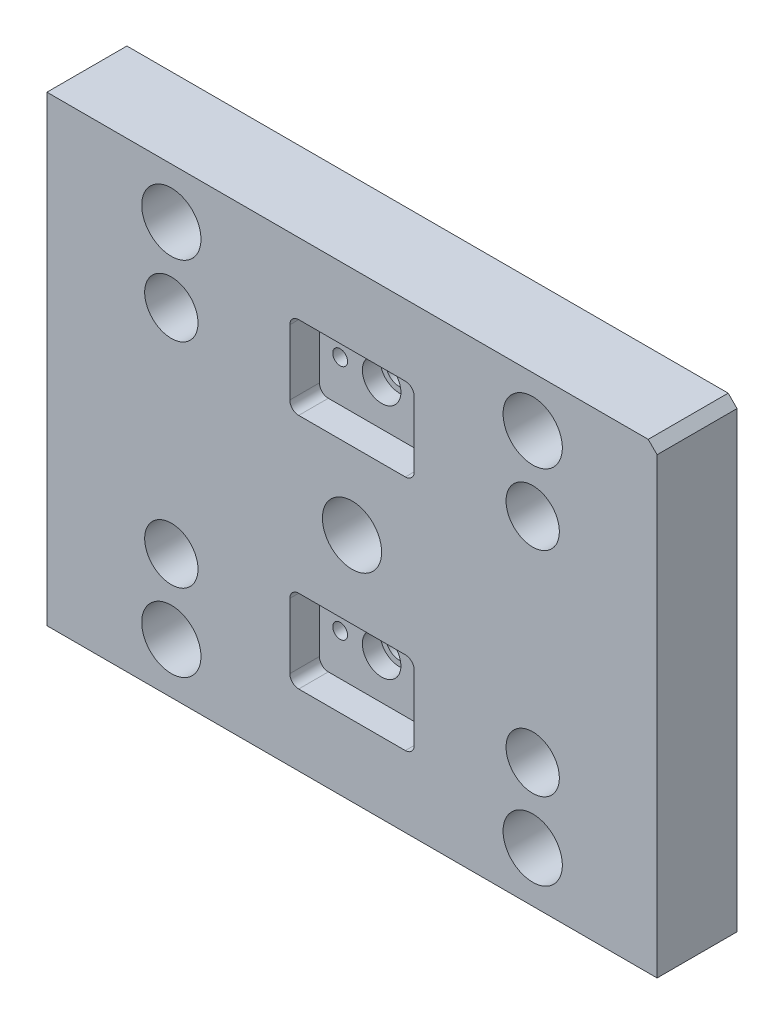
ISO-10303-21;
HEADER;
FILE_DESCRIPTION(('STEP AP214'),'2;1');
FILE_NAME('part.step','',(''),(''),'','','');
FILE_SCHEMA(('AUTOMOTIVE_DESIGN { 1 0 10303 214 1 1 1 1 }'));
ENDSEC;
DATA;
#1=APPLICATION_CONTEXT('core data for automotive mechanical design processes');
#2=APPLICATION_PROTOCOL_DEFINITION('international standard','automotive_design',2000,#1);
#3=PRODUCT_CONTEXT('',#1,'mechanical');
#4=PRODUCT('Part','Part','',(#3));
#5=PRODUCT_RELATED_PRODUCT_CATEGORY('part','',(#4));
#6=PRODUCT_DEFINITION_FORMATION('','',#4);
#7=PRODUCT_DEFINITION_CONTEXT('part definition',#1,'design');
#8=PRODUCT_DEFINITION('design','',#6,#7);
#9=PRODUCT_DEFINITION_SHAPE('','',#8);
#10=(LENGTH_UNIT() NAMED_UNIT(*) SI_UNIT(.MILLI.,.METRE.));
#11=(NAMED_UNIT(*) PLANE_ANGLE_UNIT() SI_UNIT($,.RADIAN.));
#12=(NAMED_UNIT(*) SI_UNIT($,.STERADIAN.) SOLID_ANGLE_UNIT());
#13=UNCERTAINTY_MEASURE_WITH_UNIT(LENGTH_MEASURE(1.E-05),#10,'distance_accuracy_value','');
#14=(GEOMETRIC_REPRESENTATION_CONTEXT(3) GLOBAL_UNCERTAINTY_ASSIGNED_CONTEXT((#13)) GLOBAL_UNIT_ASSIGNED_CONTEXT((#10,
#11,#12)) REPRESENTATION_CONTEXT('',''));
#15=CARTESIAN_POINT('',(0.,0.,0.));
#16=DIRECTION('',(0.,0.,1.));
#17=DIRECTION('',(1.,0.,0.));
#18=AXIS2_PLACEMENT_3D('',#15,#16,#17);
#19=CARTESIAN_POINT('',(0.,-40.,27.));
#20=DIRECTION('',(0.,0.,-1.));
#21=DIRECTION('',(-1.,0.,0.));
#22=AXIS2_PLACEMENT_3D('',#19,#20,#21);
#23=CYLINDRICAL_SURFACE('',#22,4.6);
#24=CARTESIAN_POINT('',(0.,-40.,0.));
#25=DIRECTION('',(0.,0.,-1.));
#26=DIRECTION('',(-1.,0.,0.));
#27=AXIS2_PLACEMENT_3D('',#24,#25,#26);
#28=CIRCLE('',#27,4.6);
#29=CARTESIAN_POINT('',(-4.6,-40.,0.));
#30=VERTEX_POINT('',#29);
#31=EDGE_CURVE('E318',#30,#30,#28,.T.);
#32=ORIENTED_EDGE('',*,*,#31,.T.);
#33=EDGE_LOOP('',(#32));
#34=FACE_BOUND('',#33,.T.);
#35=CARTESIAN_POINT('',(0.,-40.,11.));
#36=DIRECTION('',(0.,0.,1.));
#37=DIRECTION('',(1.,0.,0.));
#38=AXIS2_PLACEMENT_3D('',#35,#36,#37);
#39=CIRCLE('',#38,4.6);
#40=CARTESIAN_POINT('',(4.59999999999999,-40.,11.));
#41=VERTEX_POINT('',#40);
#42=EDGE_CURVE('E43',#41,#41,#39,.F.);
#43=ORIENTED_EDGE('',*,*,#42,.F.);
#44=EDGE_LOOP('',(#43));
#45=FACE_BOUND('',#44,.T.);
#46=ADVANCED_FACE('F39',(#34,#45),#23,.F.);
#47=CARTESIAN_POINT('',(0.,40.,27.));
#48=DIRECTION('',(0.,0.,-1.));
#49=DIRECTION('',(-1.,0.,0.));
#50=AXIS2_PLACEMENT_3D('',#47,#48,#49);
#51=CYLINDRICAL_SURFACE('',#50,4.6);
#52=CARTESIAN_POINT('',(0.,40.,0.));
#53=DIRECTION('',(0.,0.,-1.));
#54=DIRECTION('',(-1.,0.,0.));
#55=AXIS2_PLACEMENT_3D('',#52,#53,#54);
#56=CIRCLE('',#55,4.6);
#57=CARTESIAN_POINT('',(-4.6,40.,0.));
#58=VERTEX_POINT('',#57);
#59=EDGE_CURVE('E313',#58,#58,#56,.T.);
#60=ORIENTED_EDGE('',*,*,#59,.T.);
#61=EDGE_LOOP('',(#60));
#62=FACE_BOUND('',#61,.T.);
#63=CARTESIAN_POINT('',(0.,40.,11.));
#64=DIRECTION('',(0.,0.,1.));
#65=DIRECTION('',(1.,0.,0.));
#66=AXIS2_PLACEMENT_3D('',#63,#64,#65);
#67=CIRCLE('',#66,4.6);
#68=CARTESIAN_POINT('',(4.6,40.,11.));
#69=VERTEX_POINT('',#68);
#70=EDGE_CURVE('E311',#69,#69,#67,.F.);
#71=ORIENTED_EDGE('',*,*,#70,.F.);
#72=EDGE_LOOP('',(#71));
#73=FACE_BOUND('',#72,.T.);
#74=ADVANCED_FACE('F472',(#62,#73),#51,.F.);
#75=CARTESIAN_POINT('',(-103.,-78.,27.));
#76=DIRECTION('',(0.,0.,1.));
#77=DIRECTION('',(1.,0.,0.));
#78=AXIS2_PLACEMENT_3D('',#75,#76,#77);
#79=PLANE('',#78);
#80=CARTESIAN_POINT('',(-61.,-36.,27.));
#81=DIRECTION('',(0.,0.,-1.));
#82=DIRECTION('',(1.,0.,0.));
#83=AXIS2_PLACEMENT_3D('',#80,#81,#82);
#84=CIRCLE('',#83,9.);
#85=CARTESIAN_POINT('',(-52.,-36.,27.));
#86=VERTEX_POINT('',#85);
#87=EDGE_CURVE('E375',#86,#86,#84,.T.);
#88=ORIENTED_EDGE('',*,*,#87,.T.);
#89=EDGE_LOOP('',(#88));
#90=FACE_BOUND('',#89,.T.);
#91=CARTESIAN_POINT('',(-61.,-61.,27.));
#92=DIRECTION('',(0.,0.,-1.));
#93=DIRECTION('',(1.,0.,0.));
#94=AXIS2_PLACEMENT_3D('',#91,#92,#93);
#95=CIRCLE('',#94,10.);
#96=CARTESIAN_POINT('',(-51.,-61.,27.));
#97=VERTEX_POINT('',#96);
#98=EDGE_CURVE('E392',#97,#97,#95,.T.);
#99=ORIENTED_EDGE('',*,*,#98,.T.);
#100=EDGE_LOOP('',(#99));
#101=FACE_BOUND('',#100,.T.);
#102=CARTESIAN_POINT('',(61.,-36.,27.));
#103=DIRECTION('',(0.,0.,1.));
#104=DIRECTION('',(-1.,0.,0.));
#105=AXIS2_PLACEMENT_3D('',#102,#103,#104);
#106=CIRCLE('',#105,9.);
#107=CARTESIAN_POINT('',(70.,-36.,27.));
#108=VERTEX_POINT('',#107);
#109=EDGE_CURVE('E396',#108,#108,#106,.T.);
#110=ORIENTED_EDGE('',*,*,#109,.F.);
#111=EDGE_LOOP('',(#110));
#112=FACE_BOUND('',#111,.T.);
#113=CARTESIAN_POINT('',(61.,-61.,27.));
#114=DIRECTION('',(0.,0.,1.));
#115=DIRECTION('',(-1.,0.,0.));
#116=AXIS2_PLACEMENT_3D('',#113,#114,#115);
#117=CIRCLE('',#116,10.);
#118=CARTESIAN_POINT('',(51.,-61.,27.));
#119=VERTEX_POINT('',#118);
#120=EDGE_CURVE('E405',#119,#119,#117,.T.);
#121=ORIENTED_EDGE('',*,*,#120,.F.);
#122=EDGE_LOOP('',(#121));
#123=FACE_BOUND('',#122,.T.);
#124=DIRECTION('',(0.,1.,0.));
#125=VECTOR('',#124,1.);
#126=CARTESIAN_POINT('',(103.,78.,27.));
#127=LINE('',#126,#125);
#128=CARTESIAN_POINT('',(103.,-78.,27.));
#129=VERTEX_POINT('',#128);
#130=CARTESIAN_POINT('',(103.,75.,27.));
#131=VERTEX_POINT('',#130);
#132=EDGE_CURVE('E194',#129,#131,#127,.T.);
#133=ORIENTED_EDGE('',*,*,#132,.T.);
#134=DIRECTION('',(0.707106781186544,-0.707106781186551,0.));
#135=VECTOR('',#134,1.);
#136=CARTESIAN_POINT('',(76.5000000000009,101.499999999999,27.));
#137=LINE('',#136,#135);
#138=CARTESIAN_POINT('',(100.,78.,27.));
#139=VERTEX_POINT('',#138);
#140=EDGE_CURVE('E278',#131,#139,#137,.F.);
#141=ORIENTED_EDGE('',*,*,#140,.T.);
#142=DIRECTION('',(-1.,0.,0.));
#143=VECTOR('',#142,1.);
#144=CARTESIAN_POINT('',(-103.,78.,27.));
#145=LINE('',#144,#143);
#146=CARTESIAN_POINT('',(-103.,78.,27.));
#147=VERTEX_POINT('',#146);
#148=EDGE_CURVE('E201',#139,#147,#145,.T.);
#149=ORIENTED_EDGE('',*,*,#148,.T.);
#150=DIRECTION('',(0.,-1.,0.));
#151=VECTOR('',#150,1.);
#152=CARTESIAN_POINT('',(-103.,78.,27.));
#153=LINE('',#152,#151);
#154=CARTESIAN_POINT('',(-103.,-78.,27.));
#155=VERTEX_POINT('',#154);
#156=EDGE_CURVE('E195',#147,#155,#153,.T.);
#157=ORIENTED_EDGE('',*,*,#156,.T.);
#158=DIRECTION('',(1.,0.,0.));
#159=VECTOR('',#158,1.);
#160=CARTESIAN_POINT('',(-103.,-78.,27.));
#161=LINE('',#160,#159);
#162=EDGE_CURVE('E183',#155,#129,#161,.T.);
#163=ORIENTED_EDGE('',*,*,#162,.T.);
#164=EDGE_LOOP('',(#133,#141,#149,#157,#163));
#165=FACE_BOUND('',#164,.T.);
#166=CARTESIAN_POINT('',(-61.,61.,27.));
#167=DIRECTION('',(0.,0.,1.));
#168=DIRECTION('',(1.,0.,0.));
#169=AXIS2_PLACEMENT_3D('',#166,#167,#168);
#170=CIRCLE('',#169,10.);
#171=CARTESIAN_POINT('',(-51.,61.,27.));
#172=VERTEX_POINT('',#171);
#173=EDGE_CURVE('E431',#172,#172,#170,.T.);
#174=ORIENTED_EDGE('',*,*,#173,.F.);
#175=EDGE_LOOP('',(#174));
#176=FACE_BOUND('',#175,.T.);
#177=CARTESIAN_POINT('',(-61.,36.,27.));
#178=DIRECTION('',(0.,0.,1.));
#179=DIRECTION('',(1.,0.,0.));
#180=AXIS2_PLACEMENT_3D('',#177,#178,#179);
#181=CIRCLE('',#180,9.);
#182=CARTESIAN_POINT('',(-52.,36.,27.));
#183=VERTEX_POINT('',#182);
#184=EDGE_CURVE('E422',#183,#183,#181,.T.);
#185=ORIENTED_EDGE('',*,*,#184,.F.);
#186=EDGE_LOOP('',(#185));
#187=FACE_BOUND('',#186,.T.);
#188=CARTESIAN_POINT('',(61.,61.,27.));
#189=DIRECTION('',(0.,0.,-1.));
#190=DIRECTION('',(-1.,0.,0.));
#191=AXIS2_PLACEMENT_3D('',#188,#189,#190);
#192=CIRCLE('',#191,10.);
#193=CARTESIAN_POINT('',(51.,61.,27.));
#194=VERTEX_POINT('',#193);
#195=EDGE_CURVE('E418',#194,#194,#192,.T.);
#196=ORIENTED_EDGE('',*,*,#195,.T.);
#197=EDGE_LOOP('',(#196));
#198=FACE_BOUND('',#197,.T.);
#199=CARTESIAN_POINT('',(61.,36.,27.));
#200=DIRECTION('',(0.,0.,-1.));
#201=DIRECTION('',(-1.,0.,0.));
#202=AXIS2_PLACEMENT_3D('',#199,#200,#201);
#203=CIRCLE('',#202,9.);
#204=CARTESIAN_POINT('',(70.,36.,27.));
#205=VERTEX_POINT('',#204);
#206=EDGE_CURVE('E409',#205,#205,#203,.T.);
#207=ORIENTED_EDGE('',*,*,#206,.T.);
#208=EDGE_LOOP('',(#207));
#209=FACE_BOUND('',#208,.T.);
#210=DIRECTION('',(0.,-1.,0.));
#211=VECTOR('',#210,1.);
#212=CARTESIAN_POINT('',(-21.,-26.,27.));
#213=LINE('',#212,#211);
#214=CARTESIAN_POINT('',(-21.,-29.,27.));
#215=VERTEX_POINT('',#214);
#216=CARTESIAN_POINT('',(-21.,-51.,27.));
#217=VERTEX_POINT('',#216);
#218=EDGE_CURVE('E359',#215,#217,#213,.T.);
#219=ORIENTED_EDGE('',*,*,#218,.F.);
#220=CARTESIAN_POINT('',(-18.,-29.,27.));
#221=DIRECTION('',(0.,0.,1.));
#222=DIRECTION('',(1.,0.,0.));
#223=AXIS2_PLACEMENT_3D('',#220,#221,#222);
#224=CIRCLE('',#223,3.);
#225=CARTESIAN_POINT('',(-18.,-26.,27.));
#226=VERTEX_POINT('',#225);
#227=EDGE_CURVE('E269',#215,#226,#224,.F.);
#228=ORIENTED_EDGE('',*,*,#227,.T.);
#229=DIRECTION('',(-1.,0.,0.));
#230=VECTOR('',#229,1.);
#231=CARTESIAN_POINT('',(-21.,-26.,27.));
#232=LINE('',#231,#230);
#233=CARTESIAN_POINT('',(18.,-26.,27.));
#234=VERTEX_POINT('',#233);
#235=EDGE_CURVE('E366',#234,#226,#232,.T.);
#236=ORIENTED_EDGE('',*,*,#235,.F.);
#237=CARTESIAN_POINT('',(18.,-29.,27.));
#238=DIRECTION('',(0.,0.,1.));
#239=DIRECTION('',(1.,0.,0.));
#240=AXIS2_PLACEMENT_3D('',#237,#238,#239);
#241=CIRCLE('',#240,3.);
#242=CARTESIAN_POINT('',(21.,-29.,27.));
#243=VERTEX_POINT('',#242);
#244=EDGE_CURVE('E267',#234,#243,#241,.F.);
#245=ORIENTED_EDGE('',*,*,#244,.T.);
#246=DIRECTION('',(0.,1.,0.));
#247=VECTOR('',#246,1.);
#248=CARTESIAN_POINT('',(21.,-26.,27.));
#249=LINE('',#248,#247);
#250=CARTESIAN_POINT('',(21.,-51.,27.));
#251=VERTEX_POINT('',#250);
#252=EDGE_CURVE('E381',#251,#243,#249,.T.);
#253=ORIENTED_EDGE('',*,*,#252,.F.);
#254=CARTESIAN_POINT('',(18.,-51.,27.));
#255=DIRECTION('',(0.,0.,1.));
#256=DIRECTION('',(1.,0.,0.));
#257=AXIS2_PLACEMENT_3D('',#254,#255,#256);
#258=CIRCLE('',#257,3.);
#259=CARTESIAN_POINT('',(18.,-54.,27.));
#260=VERTEX_POINT('',#259);
#261=EDGE_CURVE('E265',#251,#260,#258,.F.);
#262=ORIENTED_EDGE('',*,*,#261,.T.);
#263=DIRECTION('',(1.,0.,0.));
#264=VECTOR('',#263,1.);
#265=CARTESIAN_POINT('',(-21.,-54.,27.));
#266=LINE('',#265,#264);
#267=CARTESIAN_POINT('',(-18.,-54.,27.));
#268=VERTEX_POINT('',#267);
#269=EDGE_CURVE('E378',#268,#260,#266,.T.);
#270=ORIENTED_EDGE('',*,*,#269,.F.);
#271=CARTESIAN_POINT('',(-18.,-51.,27.));
#272=DIRECTION('',(0.,0.,1.));
#273=DIRECTION('',(1.,0.,0.));
#274=AXIS2_PLACEMENT_3D('',#271,#272,#273);
#275=CIRCLE('',#274,3.);
#276=EDGE_CURVE('E263',#268,#217,#275,.F.);
#277=ORIENTED_EDGE('',*,*,#276,.T.);
#278=EDGE_LOOP('',(#219,#228,#236,#245,#253,#262,#270,#277));
#279=FACE_BOUND('',#278,.T.);
#280=CARTESIAN_POINT('',(0.,0.,27.));
#281=DIRECTION('',(0.,0.,1.));
#282=DIRECTION('',(1.,0.,0.));
#283=AXIS2_PLACEMENT_3D('',#280,#281,#282);
#284=CIRCLE('',#283,10.);
#285=CARTESIAN_POINT('',(10.,0.,27.));
#286=VERTEX_POINT('',#285);
#287=EDGE_CURVE('E347',#286,#286,#284,.T.);
#288=ORIENTED_EDGE('',*,*,#287,.F.);
#289=EDGE_LOOP('',(#288));
#290=FACE_BOUND('',#289,.T.);
#291=DIRECTION('',(0.,-1.,0.));
#292=VECTOR('',#291,1.);
#293=CARTESIAN_POINT('',(21.,26.,27.));
#294=LINE('',#293,#292);
#295=CARTESIAN_POINT('',(21.,51.,27.));
#296=VERTEX_POINT('',#295);
#297=CARTESIAN_POINT('',(21.,29.,27.));
#298=VERTEX_POINT('',#297);
#299=EDGE_CURVE('E352',#296,#298,#294,.T.);
#300=ORIENTED_EDGE('',*,*,#299,.T.);
#301=CARTESIAN_POINT('',(18.,29.,27.));
#302=DIRECTION('',(0.,0.,1.));
#303=DIRECTION('',(1.,0.,0.));
#304=AXIS2_PLACEMENT_3D('',#301,#302,#303);
#305=CIRCLE('',#304,3.);
#306=CARTESIAN_POINT('',(18.,26.,27.));
#307=VERTEX_POINT('',#306);
#308=EDGE_CURVE('E48',#298,#307,#305,.F.);
#309=ORIENTED_EDGE('',*,*,#308,.T.);
#310=DIRECTION('',(-1.,0.,0.));
#311=VECTOR('',#310,1.);
#312=CARTESIAN_POINT('',(-21.,26.,27.));
#313=LINE('',#312,#311);
#314=CARTESIAN_POINT('',(-18.,26.,27.));
#315=VERTEX_POINT('',#314);
#316=EDGE_CURVE('E350',#307,#315,#313,.T.);
#317=ORIENTED_EDGE('',*,*,#316,.T.);
#318=CARTESIAN_POINT('',(-18.,29.,27.));
#319=DIRECTION('',(0.,0.,1.));
#320=DIRECTION('',(1.,0.,0.));
#321=AXIS2_PLACEMENT_3D('',#318,#319,#320);
#322=CIRCLE('',#321,3.);
#323=CARTESIAN_POINT('',(-21.,29.,27.));
#324=VERTEX_POINT('',#323);
#325=EDGE_CURVE('E11',#315,#324,#322,.F.);
#326=ORIENTED_EDGE('',*,*,#325,.T.);
#327=DIRECTION('',(0.,1.,0.));
#328=VECTOR('',#327,1.);
#329=CARTESIAN_POINT('',(-21.,26.,27.));
#330=LINE('',#329,#328);
#331=CARTESIAN_POINT('',(-21.,51.,27.));
#332=VERTEX_POINT('',#331);
#333=EDGE_CURVE('E333',#324,#332,#330,.T.);
#334=ORIENTED_EDGE('',*,*,#333,.T.);
#335=CARTESIAN_POINT('',(-18.,51.,27.));
#336=DIRECTION('',(0.,0.,1.));
#337=DIRECTION('',(1.,0.,0.));
#338=AXIS2_PLACEMENT_3D('',#335,#336,#337);
#339=CIRCLE('',#338,3.);
#340=CARTESIAN_POINT('',(-18.,54.,27.));
#341=VERTEX_POINT('',#340);
#342=EDGE_CURVE('E307',#332,#341,#339,.F.);
#343=ORIENTED_EDGE('',*,*,#342,.T.);
#344=DIRECTION('',(1.,0.,0.));
#345=VECTOR('',#344,1.);
#346=CARTESIAN_POINT('',(-21.,54.,27.));
#347=LINE('',#346,#345);
#348=CARTESIAN_POINT('',(18.,54.,27.));
#349=VERTEX_POINT('',#348);
#350=EDGE_CURVE('E338',#341,#349,#347,.T.);
#351=ORIENTED_EDGE('',*,*,#350,.T.);
#352=CARTESIAN_POINT('',(18.,51.,27.));
#353=DIRECTION('',(0.,0.,1.));
#354=DIRECTION('',(1.,0.,0.));
#355=AXIS2_PLACEMENT_3D('',#352,#353,#354);
#356=CIRCLE('',#355,3.);
#357=EDGE_CURVE('E309',#349,#296,#356,.F.);
#358=ORIENTED_EDGE('',*,*,#357,.T.);
#359=EDGE_LOOP('',(#300,#309,#317,#326,#334,#343,#351,#358));
#360=FACE_BOUND('',#359,.T.);
#361=ADVANCED_FACE('F198',(#90,#101,#112,#123,#165,#176,#187,#198,#209,#279,#290,#360),#79,.T.);
#362=CARTESIAN_POINT('',(-61.,-36.,0.));
#363=DIRECTION('',(0.,0.,1.));
#364=DIRECTION('',(1.,0.,0.));
#365=AXIS2_PLACEMENT_3D('',#362,#363,#364);
#366=CYLINDRICAL_SURFACE('',#365,5.25);
#367=CARTESIAN_POINT('',(-61.,-36.,0.));
#368=DIRECTION('',(0.,0.,-1.));
#369=DIRECTION('',(1.,0.,0.));
#370=AXIS2_PLACEMENT_3D('',#367,#368,#369);
#371=CIRCLE('',#370,5.25);
#372=CARTESIAN_POINT('',(-55.75,-36.,0.));
#373=VERTEX_POINT('',#372);
#374=EDGE_CURVE('E235',#373,#373,#371,.T.);
#375=ORIENTED_EDGE('',*,*,#374,.T.);
#376=EDGE_LOOP('',(#375));
#377=FACE_BOUND('',#376,.T.);
#378=CARTESIAN_POINT('',(-61.,-36.,14.));
#379=DIRECTION('',(0.,0.,1.));
#380=DIRECTION('',(1.,0.,0.));
#381=AXIS2_PLACEMENT_3D('',#378,#379,#380);
#382=CIRCLE('',#381,5.25);
#383=CARTESIAN_POINT('',(-55.75,-36.,14.));
#384=VERTEX_POINT('',#383);
#385=EDGE_CURVE('E233',#384,#384,#382,.T.);
#386=ORIENTED_EDGE('',*,*,#385,.T.);
#387=EDGE_LOOP('',(#386));
#388=FACE_BOUND('',#387,.T.);
#389=ADVANCED_FACE('F539',(#377,#388),#366,.F.);
#390=CARTESIAN_POINT('',(-103.,-78.,0.));
#391=DIRECTION('',(0.,0.,1.));
#392=DIRECTION('',(1.,0.,0.));
#393=AXIS2_PLACEMENT_3D('',#390,#391,#392);
#394=PLANE('',#393);
#395=CARTESIAN_POINT('',(14.,-40.,0.));
#396=DIRECTION('',(0.,0.,1.));
#397=DIRECTION('',(1.,0.,0.));
#398=AXIS2_PLACEMENT_3D('',#395,#396,#397);
#399=CIRCLE('',#398,2.5);
#400=CARTESIAN_POINT('',(16.5,-40.,0.));
#401=VERTEX_POINT('',#400);
#402=EDGE_CURVE('E598',#401,#401,#399,.T.);
#403=ORIENTED_EDGE('',*,*,#402,.T.);
#404=EDGE_LOOP('',(#403));
#405=FACE_BOUND('',#404,.T.);
#406=CARTESIAN_POINT('',(-14.,-40.,0.));
#407=DIRECTION('',(0.,0.,1.));
#408=DIRECTION('',(1.,0.,0.));
#409=AXIS2_PLACEMENT_3D('',#406,#407,#408);
#410=CIRCLE('',#409,2.5);
#411=CARTESIAN_POINT('',(-11.5,-40.,0.));
#412=VERTEX_POINT('',#411);
#413=EDGE_CURVE('E602',#412,#412,#410,.T.);
#414=ORIENTED_EDGE('',*,*,#413,.T.);
#415=EDGE_LOOP('',(#414));
#416=FACE_BOUND('',#415,.T.);
#417=CARTESIAN_POINT('',(14.,40.,0.));
#418=DIRECTION('',(0.,0.,1.));
#419=DIRECTION('',(1.,0.,0.));
#420=AXIS2_PLACEMENT_3D('',#417,#418,#419);
#421=CIRCLE('',#420,2.5);
#422=CARTESIAN_POINT('',(16.5,40.,0.));
#423=VERTEX_POINT('',#422);
#424=EDGE_CURVE('E606',#423,#423,#421,.T.);
#425=ORIENTED_EDGE('',*,*,#424,.T.);
#426=EDGE_LOOP('',(#425));
#427=FACE_BOUND('',#426,.T.);
#428=CARTESIAN_POINT('',(-14.,40.,0.));
#429=DIRECTION('',(0.,0.,1.));
#430=DIRECTION('',(1.,0.,0.));
#431=AXIS2_PLACEMENT_3D('',#428,#429,#430);
#432=CIRCLE('',#431,2.5);
#433=CARTESIAN_POINT('',(-11.5,40.,0.));
#434=VERTEX_POINT('',#433);
#435=EDGE_CURVE('E610',#434,#434,#432,.T.);
#436=ORIENTED_EDGE('',*,*,#435,.T.);
#437=EDGE_LOOP('',(#436));
#438=FACE_BOUND('',#437,.T.);
#439=ORIENTED_EDGE('',*,*,#59,.F.);
#440=EDGE_LOOP('',(#439));
#441=FACE_BOUND('',#440,.T.);
#442=ORIENTED_EDGE('',*,*,#31,.F.);
#443=EDGE_LOOP('',(#442));
#444=FACE_BOUND('',#443,.T.);
#445=CARTESIAN_POINT('',(0.,0.,0.));
#446=DIRECTION('',(0.,0.,1.));
#447=DIRECTION('',(1.,0.,0.));
#448=AXIS2_PLACEMENT_3D('',#445,#446,#447);
#449=CIRCLE('',#448,10.);
#450=CARTESIAN_POINT('',(10.,0.,0.));
#451=VERTEX_POINT('',#450);
#452=EDGE_CURVE('E356',#451,#451,#449,.T.);
#453=ORIENTED_EDGE('',*,*,#452,.T.);
#454=EDGE_LOOP('',(#453));
#455=FACE_BOUND('',#454,.T.);
#456=CARTESIAN_POINT('',(-61.,-61.,0.));
#457=DIRECTION('',(0.,0.,-1.));
#458=DIRECTION('',(1.,0.,0.));
#459=AXIS2_PLACEMENT_3D('',#456,#457,#458);
#460=CIRCLE('',#459,10.);
#461=CARTESIAN_POINT('',(-51.,-61.,0.));
#462=VERTEX_POINT('',#461);
#463=EDGE_CURVE('E393',#462,#462,#460,.T.);
#464=ORIENTED_EDGE('',*,*,#463,.F.);
#465=EDGE_LOOP('',(#464));
#466=FACE_BOUND('',#465,.T.);
#467=CARTESIAN_POINT('',(61.,-36.,0.));
#468=DIRECTION('',(0.,0.,1.));
#469=DIRECTION('',(-1.,0.,0.));
#470=AXIS2_PLACEMENT_3D('',#467,#468,#469);
#471=CIRCLE('',#470,5.25);
#472=CARTESIAN_POINT('',(55.75,-36.,0.));
#473=VERTEX_POINT('',#472);
#474=EDGE_CURVE('E231',#473,#473,#471,.T.);
#475=ORIENTED_EDGE('',*,*,#474,.T.);
#476=EDGE_LOOP('',(#475));
#477=FACE_BOUND('',#476,.T.);
#478=CARTESIAN_POINT('',(61.,-61.,0.));
#479=DIRECTION('',(0.,0.,1.));
#480=DIRECTION('',(-1.,0.,0.));
#481=AXIS2_PLACEMENT_3D('',#478,#479,#480);
#482=CIRCLE('',#481,10.);
#483=CARTESIAN_POINT('',(51.,-61.,0.));
#484=VERTEX_POINT('',#483);
#485=EDGE_CURVE('E406',#484,#484,#482,.T.);
#486=ORIENTED_EDGE('',*,*,#485,.T.);
#487=EDGE_LOOP('',(#486));
#488=FACE_BOUND('',#487,.T.);
#489=CARTESIAN_POINT('',(61.,61.,0.));
#490=DIRECTION('',(0.,0.,-1.));
#491=DIRECTION('',(-1.,0.,0.));
#492=AXIS2_PLACEMENT_3D('',#489,#490,#491);
#493=CIRCLE('',#492,10.);
#494=CARTESIAN_POINT('',(51.,61.,0.));
#495=VERTEX_POINT('',#494);
#496=EDGE_CURVE('E419',#495,#495,#493,.T.);
#497=ORIENTED_EDGE('',*,*,#496,.F.);
#498=EDGE_LOOP('',(#497));
#499=FACE_BOUND('',#498,.T.);
#500=CARTESIAN_POINT('',(-61.,36.,0.));
#501=DIRECTION('',(0.,0.,1.));
#502=DIRECTION('',(1.,0.,0.));
#503=AXIS2_PLACEMENT_3D('',#500,#501,#502);
#504=CIRCLE('',#503,5.25);
#505=CARTESIAN_POINT('',(-55.75,36.,0.));
#506=VERTEX_POINT('',#505);
#507=EDGE_CURVE('E221',#506,#506,#504,.T.);
#508=ORIENTED_EDGE('',*,*,#507,.T.);
#509=EDGE_LOOP('',(#508));
#510=FACE_BOUND('',#509,.T.);
#511=CARTESIAN_POINT('',(-61.,61.,0.));
#512=DIRECTION('',(0.,0.,1.));
#513=DIRECTION('',(1.,0.,0.));
#514=AXIS2_PLACEMENT_3D('',#511,#512,#513);
#515=CIRCLE('',#514,10.);
#516=CARTESIAN_POINT('',(-51.,61.,0.));
#517=VERTEX_POINT('',#516);
#518=EDGE_CURVE('E432',#517,#517,#515,.T.);
#519=ORIENTED_EDGE('',*,*,#518,.T.);
#520=EDGE_LOOP('',(#519));
#521=FACE_BOUND('',#520,.T.);
#522=DIRECTION('',(-1.,0.,0.));
#523=VECTOR('',#522,1.);
#524=CARTESIAN_POINT('',(-103.,78.,0.));
#525=LINE('',#524,#523);
#526=CARTESIAN_POINT('',(100.,78.,0.));
#527=VERTEX_POINT('',#526);
#528=CARTESIAN_POINT('',(-103.,78.,0.));
#529=VERTEX_POINT('',#528);
#530=EDGE_CURVE('E205',#527,#529,#525,.T.);
#531=ORIENTED_EDGE('',*,*,#530,.F.);
#532=DIRECTION('',(-0.707106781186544,0.707106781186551,0.));
#533=VECTOR('',#532,1.);
#534=CARTESIAN_POINT('',(100.,78.,0.));
#535=LINE('',#534,#533);
#536=CARTESIAN_POINT('',(103.,75.,0.));
#537=VERTEX_POINT('',#536);
#538=EDGE_CURVE('E274',#527,#537,#535,.F.);
#539=ORIENTED_EDGE('',*,*,#538,.T.);
#540=DIRECTION('',(0.,1.,0.));
#541=VECTOR('',#540,1.);
#542=CARTESIAN_POINT('',(103.,78.,0.));
#543=LINE('',#542,#541);
#544=CARTESIAN_POINT('',(103.,-78.,0.));
#545=VERTEX_POINT('',#544);
#546=EDGE_CURVE('E442',#545,#537,#543,.T.);
#547=ORIENTED_EDGE('',*,*,#546,.F.);
#548=DIRECTION('',(1.,0.,0.));
#549=VECTOR('',#548,1.);
#550=CARTESIAN_POINT('',(-103.,-78.,0.));
#551=LINE('',#550,#549);
#552=CARTESIAN_POINT('',(-103.,-78.,0.));
#553=VERTEX_POINT('',#552);
#554=EDGE_CURVE('E440',#553,#545,#551,.T.);
#555=ORIENTED_EDGE('',*,*,#554,.F.);
#556=DIRECTION('',(0.,-1.,0.));
#557=VECTOR('',#556,1.);
#558=CARTESIAN_POINT('',(-103.,78.,0.));
#559=LINE('',#558,#557);
#560=EDGE_CURVE('E209',#529,#553,#559,.T.);
#561=ORIENTED_EDGE('',*,*,#560,.F.);
#562=EDGE_LOOP('',(#531,#539,#547,#555,#561));
#563=FACE_BOUND('',#562,.T.);
#564=CARTESIAN_POINT('',(61.,36.,0.));
#565=DIRECTION('',(0.,0.,-1.));
#566=DIRECTION('',(-1.,0.,0.));
#567=AXIS2_PLACEMENT_3D('',#564,#565,#566);
#568=CIRCLE('',#567,5.25);
#569=CARTESIAN_POINT('',(55.75,36.,0.));
#570=VERTEX_POINT('',#569);
#571=EDGE_CURVE('E226',#570,#570,#568,.T.);
#572=ORIENTED_EDGE('',*,*,#571,.F.);
#573=EDGE_LOOP('',(#572));
#574=FACE_BOUND('',#573,.T.);
#575=ORIENTED_EDGE('',*,*,#374,.F.);
#576=EDGE_LOOP('',(#575));
#577=FACE_BOUND('',#576,.T.);
#578=ADVANCED_FACE('F448',(#405,#416,#427,#438,#441,#444,#455,#466,#477,#488,#499,#510,#521,
#563,#574,#577),#394,.F.);
#579=CARTESIAN_POINT('',(61.,-36.,0.));
#580=DIRECTION('',(0.,0.,1.));
#581=DIRECTION('',(1.,0.,0.));
#582=AXIS2_PLACEMENT_3D('',#579,#580,#581);
#583=CYLINDRICAL_SURFACE('',#582,5.25);
#584=ORIENTED_EDGE('',*,*,#474,.F.);
#585=EDGE_LOOP('',(#584));
#586=FACE_BOUND('',#585,.T.);
#587=CARTESIAN_POINT('',(61.,-36.,14.));
#588=DIRECTION('',(0.,0.,1.));
#589=DIRECTION('',(1.,0.,0.));
#590=AXIS2_PLACEMENT_3D('',#587,#588,#589);
#591=CIRCLE('',#590,5.25);
#592=CARTESIAN_POINT('',(66.25,-36.,14.));
#593=VERTEX_POINT('',#592);
#594=EDGE_CURVE('E228',#593,#593,#591,.F.);
#595=ORIENTED_EDGE('',*,*,#594,.F.);
#596=EDGE_LOOP('',(#595));
#597=FACE_BOUND('',#596,.T.);
#598=ADVANCED_FACE('F555',(#586,#597),#583,.F.);
#599=CARTESIAN_POINT('',(61.,36.,0.));
#600=DIRECTION('',(0.,0.,1.));
#601=DIRECTION('',(1.,0.,0.));
#602=AXIS2_PLACEMENT_3D('',#599,#600,#601);
#603=CYLINDRICAL_SURFACE('',#602,5.25);
#604=ORIENTED_EDGE('',*,*,#571,.T.);
#605=EDGE_LOOP('',(#604));
#606=FACE_BOUND('',#605,.T.);
#607=CARTESIAN_POINT('',(61.,36.,14.));
#608=DIRECTION('',(0.,0.,1.));
#609=DIRECTION('',(1.,0.,0.));
#610=AXIS2_PLACEMENT_3D('',#607,#608,#609);
#611=CIRCLE('',#610,5.25);
#612=CARTESIAN_POINT('',(66.25,36.,14.));
#613=VERTEX_POINT('',#612);
#614=EDGE_CURVE('E223',#613,#613,#611,.T.);
#615=ORIENTED_EDGE('',*,*,#614,.T.);
#616=EDGE_LOOP('',(#615));
#617=FACE_BOUND('',#616,.T.);
#618=ADVANCED_FACE('F558',(#606,#617),#603,.F.);
#619=CARTESIAN_POINT('',(-61.,36.,0.));
#620=DIRECTION('',(0.,0.,1.));
#621=DIRECTION('',(1.,0.,0.));
#622=AXIS2_PLACEMENT_3D('',#619,#620,#621);
#623=CYLINDRICAL_SURFACE('',#622,5.25);
#624=ORIENTED_EDGE('',*,*,#507,.F.);
#625=EDGE_LOOP('',(#624));
#626=FACE_BOUND('',#625,.T.);
#627=CARTESIAN_POINT('',(-61.,36.,14.));
#628=DIRECTION('',(0.,0.,1.));
#629=DIRECTION('',(1.,0.,0.));
#630=AXIS2_PLACEMENT_3D('',#627,#628,#629);
#631=CIRCLE('',#630,5.25);
#632=CARTESIAN_POINT('',(-55.75,36.,14.));
#633=VERTEX_POINT('',#632);
#634=EDGE_CURVE('E218',#633,#633,#631,.F.);
#635=ORIENTED_EDGE('',*,*,#634,.F.);
#636=EDGE_LOOP('',(#635));
#637=FACE_BOUND('',#636,.T.);
#638=ADVANCED_FACE('F574',(#626,#637),#623,.F.);
#639=CARTESIAN_POINT('',(-103.,78.,27.));
#640=DIRECTION('',(1.,0.,0.));
#641=DIRECTION('',(0.,1.,0.));
#642=AXIS2_PLACEMENT_3D('',#639,#640,#641);
#643=PLANE('',#642);
#644=ORIENTED_EDGE('',*,*,#560,.T.);
#645=DIRECTION('',(0.,0.,-1.));
#646=VECTOR('',#645,1.);
#647=CARTESIAN_POINT('',(-103.,-78.,27.));
#648=LINE('',#647,#646);
#649=EDGE_CURVE('E187',#155,#553,#648,.T.);
#650=ORIENTED_EDGE('',*,*,#649,.F.);
#651=ORIENTED_EDGE('',*,*,#156,.F.);
#652=DIRECTION('',(0.,0.,-1.));
#653=VECTOR('',#652,1.);
#654=CARTESIAN_POINT('',(-103.,78.,27.));
#655=LINE('',#654,#653);
#656=EDGE_CURVE('E214',#147,#529,#655,.T.);
#657=ORIENTED_EDGE('',*,*,#656,.T.);
#658=EDGE_LOOP('',(#644,#650,#651,#657));
#659=FACE_BOUND('',#658,.T.);
#660=ADVANCED_FACE('F207',(#659),#643,.F.);
#661=CARTESIAN_POINT('',(-103.,-78.,27.));
#662=DIRECTION('',(0.,1.,0.));
#663=DIRECTION('',(0.,0.,1.));
#664=AXIS2_PLACEMENT_3D('',#661,#662,#663);
#665=PLANE('',#664);
#666=ORIENTED_EDGE('',*,*,#554,.T.);
#667=DIRECTION('',(0.,0.,-1.));
#668=VECTOR('',#667,1.);
#669=CARTESIAN_POINT('',(103.,-78.,27.));
#670=LINE('',#669,#668);
#671=EDGE_CURVE('E190',#129,#545,#670,.T.);
#672=ORIENTED_EDGE('',*,*,#671,.F.);
#673=ORIENTED_EDGE('',*,*,#162,.F.);
#674=ORIENTED_EDGE('',*,*,#649,.T.);
#675=EDGE_LOOP('',(#666,#672,#673,#674));
#676=FACE_BOUND('',#675,.T.);
#677=ADVANCED_FACE('F185',(#676),#665,.F.);
#678=CARTESIAN_POINT('',(103.,78.,27.));
#679=DIRECTION('',(-1.,0.,0.));
#680=DIRECTION('',(0.,-1.,0.));
#681=AXIS2_PLACEMENT_3D('',#678,#679,#680);
#682=PLANE('',#681);
#683=ORIENTED_EDGE('',*,*,#546,.T.);
#684=DIRECTION('',(0.,0.,1.));
#685=VECTOR('',#684,1.);
#686=CARTESIAN_POINT('',(103.,75.,27.));
#687=LINE('',#686,#685);
#688=EDGE_CURVE('E276',#537,#131,#687,.T.);
#689=ORIENTED_EDGE('',*,*,#688,.T.);
#690=ORIENTED_EDGE('',*,*,#132,.F.);
#691=ORIENTED_EDGE('',*,*,#671,.T.);
#692=EDGE_LOOP('',(#683,#689,#690,#691));
#693=FACE_BOUND('',#692,.T.);
#694=ADVANCED_FACE('F452',(#693),#682,.F.);
#695=CARTESIAN_POINT('',(-103.,78.,27.));
#696=DIRECTION('',(0.,-1.,0.));
#697=DIRECTION('',(0.,0.,-1.));
#698=AXIS2_PLACEMENT_3D('',#695,#696,#697);
#699=PLANE('',#698);
#700=ORIENTED_EDGE('',*,*,#148,.F.);
#701=DIRECTION('',(0.,0.,-1.));
#702=VECTOR('',#701,1.);
#703=CARTESIAN_POINT('',(100.,78.,27.));
#704=LINE('',#703,#702);
#705=EDGE_CURVE('E271',#139,#527,#704,.T.);
#706=ORIENTED_EDGE('',*,*,#705,.T.);
#707=ORIENTED_EDGE('',*,*,#530,.T.);
#708=ORIENTED_EDGE('',*,*,#656,.F.);
#709=EDGE_LOOP('',(#700,#706,#707,#708));
#710=FACE_BOUND('',#709,.T.);
#711=ADVANCED_FACE('F458',(#710),#699,.F.);
#712=CARTESIAN_POINT('',(-61.,61.,0.));
#713=DIRECTION('',(0.,0.,1.));
#714=DIRECTION('',(1.,0.,0.));
#715=AXIS2_PLACEMENT_3D('',#712,#713,#714);
#716=CYLINDRICAL_SURFACE('',#715,10.);
#717=ORIENTED_EDGE('',*,*,#518,.F.);
#718=EDGE_LOOP('',(#717));
#719=FACE_BOUND('',#718,.T.);
#720=ORIENTED_EDGE('',*,*,#173,.T.);
#721=EDGE_LOOP('',(#720));
#722=FACE_BOUND('',#721,.T.);
#723=ADVANCED_FACE('F460',(#719,#722),#716,.F.);
#724=CARTESIAN_POINT('',(-61.,36.,14.));
#725=DIRECTION('',(0.,0.,1.));
#726=DIRECTION('',(1.,0.,0.));
#727=AXIS2_PLACEMENT_3D('',#724,#725,#726);
#728=PLANE('',#727);
#729=CARTESIAN_POINT('',(-61.,36.,14.));
#730=DIRECTION('',(0.,0.,1.));
#731=DIRECTION('',(1.,0.,0.));
#732=AXIS2_PLACEMENT_3D('',#729,#730,#731);
#733=CIRCLE('',#732,9.);
#734=CARTESIAN_POINT('',(-52.,36.,14.));
#735=VERTEX_POINT('',#734);
#736=EDGE_CURVE('E222',#735,#735,#733,.T.);
#737=ORIENTED_EDGE('',*,*,#736,.T.);
#738=EDGE_LOOP('',(#737));
#739=FACE_BOUND('',#738,.T.);
#740=ORIENTED_EDGE('',*,*,#634,.T.);
#741=EDGE_LOOP('',(#740));
#742=FACE_BOUND('',#741,.T.);
#743=ADVANCED_FACE('F466',(#739,#742),#728,.T.);
#744=CARTESIAN_POINT('',(-61.,36.,14.));
#745=DIRECTION('',(0.,0.,1.));
#746=DIRECTION('',(1.,0.,0.));
#747=AXIS2_PLACEMENT_3D('',#744,#745,#746);
#748=CYLINDRICAL_SURFACE('',#747,9.);
#749=CARTESIAN_POINT('',(-52.,36.,14.));
#750=CARTESIAN_POINT('',(-52.,36.,14.1354166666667));
#751=CARTESIAN_POINT('',(-52.,36.,14.2708333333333));
#752=CARTESIAN_POINT('',(-52.,36.,14.5416666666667));
#753=CARTESIAN_POINT('',(-52.,36.,14.6770833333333));
#754=CARTESIAN_POINT('',(-52.,36.,14.9479166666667));
#755=CARTESIAN_POINT('',(-52.,36.,15.0833333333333));
#756=CARTESIAN_POINT('',(-52.,36.,15.3541666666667));
#757=CARTESIAN_POINT('',(-52.,36.,15.4895833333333));
#758=CARTESIAN_POINT('',(-52.,36.,15.7604166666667));
#759=CARTESIAN_POINT('',(-52.,36.,15.8958333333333));
#760=CARTESIAN_POINT('',(-52.,36.,16.1666666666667));
#761=CARTESIAN_POINT('',(-52.,36.,16.3020833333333));
#762=CARTESIAN_POINT('',(-52.,36.,16.5729166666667));
#763=CARTESIAN_POINT('',(-52.,36.,16.7083333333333));
#764=CARTESIAN_POINT('',(-52.,36.,16.9791666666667));
#765=CARTESIAN_POINT('',(-52.,36.,17.1145833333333));
#766=CARTESIAN_POINT('',(-52.,36.,17.3854166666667));
#767=CARTESIAN_POINT('',(-52.,36.,17.5208333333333));
#768=CARTESIAN_POINT('',(-52.,36.,17.7916666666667));
#769=CARTESIAN_POINT('',(-52.,36.,17.9270833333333));
#770=CARTESIAN_POINT('',(-52.,36.,18.1979166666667));
#771=CARTESIAN_POINT('',(-52.,36.,18.3333333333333));
#772=CARTESIAN_POINT('',(-52.,36.,18.6041666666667));
#773=CARTESIAN_POINT('',(-52.,36.,18.7395833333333));
#774=CARTESIAN_POINT('',(-52.,36.,19.0104166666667));
#775=CARTESIAN_POINT('',(-52.,36.,19.1458333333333));
#776=CARTESIAN_POINT('',(-52.,36.,19.4166666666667));
#777=CARTESIAN_POINT('',(-52.,36.,19.5520833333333));
#778=CARTESIAN_POINT('',(-52.,36.,19.8229166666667));
#779=CARTESIAN_POINT('',(-52.,36.,19.9583333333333));
#780=CARTESIAN_POINT('',(-52.,36.,20.2291666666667));
#781=CARTESIAN_POINT('',(-52.,36.,20.3645833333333));
#782=CARTESIAN_POINT('',(-52.,36.,20.6354166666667));
#783=CARTESIAN_POINT('',(-52.,36.,20.7708333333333));
#784=CARTESIAN_POINT('',(-52.,36.,21.0416666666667));
#785=CARTESIAN_POINT('',(-52.,36.,21.1770833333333));
#786=CARTESIAN_POINT('',(-52.,36.,21.4479166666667));
#787=CARTESIAN_POINT('',(-52.,36.,21.5833333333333));
#788=CARTESIAN_POINT('',(-52.,36.,21.8541666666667));
#789=CARTESIAN_POINT('',(-52.,36.,21.9895833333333));
#790=CARTESIAN_POINT('',(-52.,36.,22.2604166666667));
#791=CARTESIAN_POINT('',(-52.,36.,22.3958333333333));
#792=CARTESIAN_POINT('',(-52.,36.,22.6666666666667));
#793=CARTESIAN_POINT('',(-52.,36.,22.8020833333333));
#794=CARTESIAN_POINT('',(-52.,36.,23.0729166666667));
#795=CARTESIAN_POINT('',(-52.,36.,23.2083333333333));
#796=CARTESIAN_POINT('',(-52.,36.,23.4791666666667));
#797=CARTESIAN_POINT('',(-52.,36.,23.6145833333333));
#798=CARTESIAN_POINT('',(-52.,36.,23.8854166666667));
#799=CARTESIAN_POINT('',(-52.,36.,24.0208333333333));
#800=CARTESIAN_POINT('',(-52.,36.,24.2916666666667));
#801=CARTESIAN_POINT('',(-52.,36.,24.4270833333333));
#802=CARTESIAN_POINT('',(-52.,36.,24.6979166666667));
#803=CARTESIAN_POINT('',(-52.,36.,24.8333333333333));
#804=CARTESIAN_POINT('',(-52.,36.,25.1041666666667));
#805=CARTESIAN_POINT('',(-52.,36.,25.2395833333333));
#806=CARTESIAN_POINT('',(-52.,36.,25.5104166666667));
#807=CARTESIAN_POINT('',(-52.,36.,25.6458333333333));
#808=CARTESIAN_POINT('',(-52.,36.,25.9166666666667));
#809=CARTESIAN_POINT('',(-52.,36.,26.0520833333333));
#810=CARTESIAN_POINT('',(-52.,36.,26.3229166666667));
#811=CARTESIAN_POINT('',(-52.,36.,26.4583333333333));
#812=CARTESIAN_POINT('',(-52.,36.,26.7291666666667));
#813=CARTESIAN_POINT('',(-52.,36.,26.8645833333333));
#814=CARTESIAN_POINT('',(-52.,36.,27.));
#815=B_SPLINE_CURVE_WITH_KNOTS('',3,(#749,#750,#751,#752,#753,#754,#755,#756,#757,#758,#759,
#760,#761,#762,#763,#764,#765,#766,#767,#768,#769,#770,#771,#772,#773,#774,#775,#776,#777,#778,
#779,#780,#781,#782,#783,#784,#785,#786,#787,#788,#789,#790,#791,#792,#793,#794,#795,#796,#797,
#798,#799,#800,#801,#802,#803,#804,#805,#806,#807,#808,#809,#810,#811,#812,#813,#814),
.UNSPECIFIED.,.F.,.F.,(4,2,2,2,2,2,2,2,2,2,2,2,2,2,2,2,2,2,2,2,2,2,2,2,2,2,2,2,2,2,2,2,4),(0.,
0.406249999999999,0.812499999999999,1.21875,1.625,2.03125,2.4375,2.84375,3.25,3.65625,4.0625,
4.46875,4.875,5.28125,5.6875,6.09375,6.5,6.90625,7.3125,7.71875,8.125,8.53125,8.9375,9.34375,
9.75,10.15625,10.5625,10.96875,11.375,11.78125,12.1875,12.59375,13.),.UNSPECIFIED.);
#816=EDGE_CURVE('BSEAM578',#735,#183,#815,.T.);
#817=ORIENTED_EDGE('',*,*,#736,.F.);
#818=ORIENTED_EDGE('',*,*,#184,.T.);
#819=ORIENTED_EDGE('',*,*,#816,.T.);
#820=ORIENTED_EDGE('',*,*,#816,.F.);
#821=EDGE_LOOP('',(#817,#819,#818,#820));
#822=FACE_BOUND('',#821,.T.);
#823=ADVANCED_FACE('F578',(#822),#748,.F.);
#824=CARTESIAN_POINT('',(61.,61.,0.));
#825=DIRECTION('',(0.,0.,1.));
#826=DIRECTION('',(1.,0.,0.));
#827=AXIS2_PLACEMENT_3D('',#824,#825,#826);
#828=CYLINDRICAL_SURFACE('',#827,10.);
#829=ORIENTED_EDGE('',*,*,#496,.T.);
#830=EDGE_LOOP('',(#829));
#831=FACE_BOUND('',#830,.T.);
#832=ORIENTED_EDGE('',*,*,#195,.F.);
#833=EDGE_LOOP('',(#832));
#834=FACE_BOUND('',#833,.T.);
#835=ADVANCED_FACE('F570',(#831,#834),#828,.F.);
#836=CARTESIAN_POINT('',(61.,36.,14.));
#837=DIRECTION('',(0.,0.,1.));
#838=DIRECTION('',(1.,0.,0.));
#839=AXIS2_PLACEMENT_3D('',#836,#837,#838);
#840=CYLINDRICAL_SURFACE('',#839,9.);
#841=CARTESIAN_POINT('',(61.,36.,14.));
#842=DIRECTION('',(0.,0.,-1.));
#843=DIRECTION('',(-1.,0.,0.));
#844=AXIS2_PLACEMENT_3D('',#841,#842,#843);
#845=CIRCLE('',#844,9.);
#846=CARTESIAN_POINT('',(70.,36.,14.));
#847=VERTEX_POINT('',#846);
#848=EDGE_CURVE('E227',#847,#847,#845,.T.);
#849=CARTESIAN_POINT('',(70.,36.,14.));
#850=CARTESIAN_POINT('',(70.,36.,14.1354166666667));
#851=CARTESIAN_POINT('',(70.,36.,14.2708333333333));
#852=CARTESIAN_POINT('',(70.,36.,14.5416666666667));
#853=CARTESIAN_POINT('',(70.,36.,14.6770833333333));
#854=CARTESIAN_POINT('',(70.,36.,14.9479166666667));
#855=CARTESIAN_POINT('',(70.,36.,15.0833333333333));
#856=CARTESIAN_POINT('',(70.,36.,15.3541666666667));
#857=CARTESIAN_POINT('',(70.,36.,15.4895833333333));
#858=CARTESIAN_POINT('',(70.,36.,15.7604166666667));
#859=CARTESIAN_POINT('',(70.,36.,15.8958333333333));
#860=CARTESIAN_POINT('',(70.,36.,16.1666666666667));
#861=CARTESIAN_POINT('',(70.,36.,16.3020833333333));
#862=CARTESIAN_POINT('',(70.,36.,16.5729166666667));
#863=CARTESIAN_POINT('',(70.,36.,16.7083333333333));
#864=CARTESIAN_POINT('',(70.,36.,16.9791666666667));
#865=CARTESIAN_POINT('',(70.,36.,17.1145833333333));
#866=CARTESIAN_POINT('',(70.,36.,17.3854166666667));
#867=CARTESIAN_POINT('',(70.,36.,17.5208333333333));
#868=CARTESIAN_POINT('',(70.,36.,17.7916666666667));
#869=CARTESIAN_POINT('',(70.,36.,17.9270833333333));
#870=CARTESIAN_POINT('',(70.,36.,18.1979166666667));
#871=CARTESIAN_POINT('',(70.,36.,18.3333333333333));
#872=CARTESIAN_POINT('',(70.,36.,18.6041666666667));
#873=CARTESIAN_POINT('',(70.,36.,18.7395833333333));
#874=CARTESIAN_POINT('',(70.,36.,19.0104166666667));
#875=CARTESIAN_POINT('',(70.,36.,19.1458333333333));
#876=CARTESIAN_POINT('',(70.,36.,19.4166666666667));
#877=CARTESIAN_POINT('',(70.,36.,19.5520833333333));
#878=CARTESIAN_POINT('',(70.,36.,19.8229166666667));
#879=CARTESIAN_POINT('',(70.,36.,19.9583333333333));
#880=CARTESIAN_POINT('',(70.,36.,20.2291666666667));
#881=CARTESIAN_POINT('',(70.,36.,20.3645833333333));
#882=CARTESIAN_POINT('',(70.,36.,20.6354166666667));
#883=CARTESIAN_POINT('',(70.,36.,20.7708333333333));
#884=CARTESIAN_POINT('',(70.,36.,21.0416666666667));
#885=CARTESIAN_POINT('',(70.,36.,21.1770833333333));
#886=CARTESIAN_POINT('',(70.,36.,21.4479166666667));
#887=CARTESIAN_POINT('',(70.,36.,21.5833333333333));
#888=CARTESIAN_POINT('',(70.,36.,21.8541666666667));
#889=CARTESIAN_POINT('',(70.,36.,21.9895833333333));
#890=CARTESIAN_POINT('',(70.,36.,22.2604166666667));
#891=CARTESIAN_POINT('',(70.,36.,22.3958333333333));
#892=CARTESIAN_POINT('',(70.,36.,22.6666666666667));
#893=CARTESIAN_POINT('',(70.,36.,22.8020833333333));
#894=CARTESIAN_POINT('',(70.,36.,23.0729166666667));
#895=CARTESIAN_POINT('',(70.,36.,23.2083333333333));
#896=CARTESIAN_POINT('',(70.,36.,23.4791666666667));
#897=CARTESIAN_POINT('',(70.,36.,23.6145833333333));
#898=CARTESIAN_POINT('',(70.,36.,23.8854166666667));
#899=CARTESIAN_POINT('',(70.,36.,24.0208333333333));
#900=CARTESIAN_POINT('',(70.,36.,24.2916666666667));
#901=CARTESIAN_POINT('',(70.,36.,24.4270833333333));
#902=CARTESIAN_POINT('',(70.,36.,24.6979166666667));
#903=CARTESIAN_POINT('',(70.,36.,24.8333333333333));
#904=CARTESIAN_POINT('',(70.,36.,25.1041666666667));
#905=CARTESIAN_POINT('',(70.,36.,25.2395833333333));
#906=CARTESIAN_POINT('',(70.,36.,25.5104166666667));
#907=CARTESIAN_POINT('',(70.,36.,25.6458333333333));
#908=CARTESIAN_POINT('',(70.,36.,25.9166666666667));
#909=CARTESIAN_POINT('',(70.,36.,26.0520833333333));
#910=CARTESIAN_POINT('',(70.,36.,26.3229166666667));
#911=CARTESIAN_POINT('',(70.,36.,26.4583333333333));
#912=CARTESIAN_POINT('',(70.,36.,26.7291666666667));
#913=CARTESIAN_POINT('',(70.,36.,26.8645833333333));
#914=CARTESIAN_POINT('',(70.,36.,27.));
#915=B_SPLINE_CURVE_WITH_KNOTS('',3,(#849,#850,#851,#852,#853,#854,#855,#856,#857,#858,#859,
#860,#861,#862,#863,#864,#865,#866,#867,#868,#869,#870,#871,#872,#873,#874,#875,#876,#877,#878,
#879,#880,#881,#882,#883,#884,#885,#886,#887,#888,#889,#890,#891,#892,#893,#894,#895,#896,#897,
#898,#899,#900,#901,#902,#903,#904,#905,#906,#907,#908,#909,#910,#911,#912,#913,#914),
.UNSPECIFIED.,.F.,.F.,(4,2,2,2,2,2,2,2,2,2,2,2,2,2,2,2,2,2,2,2,2,2,2,2,2,2,2,2,2,2,2,2,4),(0.,
0.40625,0.812500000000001,1.21875,1.625,2.03125,2.4375,2.84375,3.25,3.65625,4.0625,4.46875,
4.875,5.28125,5.6875,6.09375,6.5,6.90625,7.3125,7.71875,8.125,8.53125,8.9375,9.34375,9.75,
10.15625,10.5625,10.96875,11.375,11.78125,12.1875,12.59375,13.),.UNSPECIFIED.);
#916=EDGE_CURVE('BSEAM566',#847,#205,#915,.T.);
#917=ORIENTED_EDGE('',*,*,#848,.T.);
#918=ORIENTED_EDGE('',*,*,#206,.F.);
#919=ORIENTED_EDGE('',*,*,#916,.T.);
#920=ORIENTED_EDGE('',*,*,#916,.F.);
#921=EDGE_LOOP('',(#917,#919,#918,#920));
#922=FACE_BOUND('',#921,.T.);
#923=ADVANCED_FACE('F566',(#922),#840,.F.);
#924=CARTESIAN_POINT('',(61.,36.,14.));
#925=DIRECTION('',(0.,0.,1.));
#926=DIRECTION('',(-1.,0.,0.));
#927=AXIS2_PLACEMENT_3D('',#924,#925,#926);
#928=PLANE('',#927);
#929=ORIENTED_EDGE('',*,*,#614,.F.);
#930=EDGE_LOOP('',(#929));
#931=FACE_BOUND('',#930,.T.);
#932=ORIENTED_EDGE('',*,*,#848,.F.);
#933=EDGE_LOOP('',(#932));
#934=FACE_BOUND('',#933,.T.);
#935=ADVANCED_FACE('F562',(#931,#934),#928,.T.);
#936=CARTESIAN_POINT('',(61.,-61.,0.));
#937=DIRECTION('',(0.,0.,1.));
#938=DIRECTION('',(1.,0.,0.));
#939=AXIS2_PLACEMENT_3D('',#936,#937,#938);
#940=CYLINDRICAL_SURFACE('',#939,10.);
#941=ORIENTED_EDGE('',*,*,#485,.F.);
#942=EDGE_LOOP('',(#941));
#943=FACE_BOUND('',#942,.T.);
#944=ORIENTED_EDGE('',*,*,#120,.T.);
#945=EDGE_LOOP('',(#944));
#946=FACE_BOUND('',#945,.T.);
#947=ADVANCED_FACE('F550',(#943,#946),#940,.F.);
#948=CARTESIAN_POINT('',(61.,-36.,14.));
#949=DIRECTION('',(0.,0.,1.));
#950=DIRECTION('',(-1.,0.,0.));
#951=AXIS2_PLACEMENT_3D('',#948,#949,#950);
#952=PLANE('',#951);
#953=CARTESIAN_POINT('',(61.,-36.,14.));
#954=DIRECTION('',(0.,0.,1.));
#955=DIRECTION('',(-1.,0.,0.));
#956=AXIS2_PLACEMENT_3D('',#953,#954,#955);
#957=CIRCLE('',#956,9.);
#958=CARTESIAN_POINT('',(70.,-36.,14.));
#959=VERTEX_POINT('',#958);
#960=EDGE_CURVE('E232',#959,#959,#957,.T.);
#961=ORIENTED_EDGE('',*,*,#960,.T.);
#962=EDGE_LOOP('',(#961));
#963=FACE_BOUND('',#962,.T.);
#964=ORIENTED_EDGE('',*,*,#594,.T.);
#965=EDGE_LOOP('',(#964));
#966=FACE_BOUND('',#965,.T.);
#967=ADVANCED_FACE('F547',(#963,#966),#952,.T.);
#968=CARTESIAN_POINT('',(61.,-36.,14.));
#969=DIRECTION('',(0.,0.,1.));
#970=DIRECTION('',(1.,0.,0.));
#971=AXIS2_PLACEMENT_3D('',#968,#969,#970);
#972=CYLINDRICAL_SURFACE('',#971,9.);
#973=CARTESIAN_POINT('',(70.,-36.,14.));
#974=CARTESIAN_POINT('',(70.,-36.,14.1354166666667));
#975=CARTESIAN_POINT('',(70.,-36.,14.2708333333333));
#976=CARTESIAN_POINT('',(70.,-36.,14.5416666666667));
#977=CARTESIAN_POINT('',(70.,-36.,14.6770833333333));
#978=CARTESIAN_POINT('',(70.,-36.,14.9479166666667));
#979=CARTESIAN_POINT('',(70.,-36.,15.0833333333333));
#980=CARTESIAN_POINT('',(70.,-36.,15.3541666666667));
#981=CARTESIAN_POINT('',(70.,-36.,15.4895833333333));
#982=CARTESIAN_POINT('',(70.,-36.,15.7604166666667));
#983=CARTESIAN_POINT('',(70.,-36.,15.8958333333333));
#984=CARTESIAN_POINT('',(70.,-36.,16.1666666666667));
#985=CARTESIAN_POINT('',(70.,-36.,16.3020833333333));
#986=CARTESIAN_POINT('',(70.,-36.,16.5729166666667));
#987=CARTESIAN_POINT('',(70.,-36.,16.7083333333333));
#988=CARTESIAN_POINT('',(70.,-36.,16.9791666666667));
#989=CARTESIAN_POINT('',(70.,-36.,17.1145833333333));
#990=CARTESIAN_POINT('',(70.,-36.,17.3854166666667));
#991=CARTESIAN_POINT('',(70.,-36.,17.5208333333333));
#992=CARTESIAN_POINT('',(70.,-36.,17.7916666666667));
#993=CARTESIAN_POINT('',(70.,-36.,17.9270833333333));
#994=CARTESIAN_POINT('',(70.,-36.,18.1979166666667));
#995=CARTESIAN_POINT('',(70.,-36.,18.3333333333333));
#996=CARTESIAN_POINT('',(70.,-36.,18.6041666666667));
#997=CARTESIAN_POINT('',(70.,-36.,18.7395833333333));
#998=CARTESIAN_POINT('',(70.,-36.,19.0104166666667));
#999=CARTESIAN_POINT('',(70.,-36.,19.1458333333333));
#1000=CARTESIAN_POINT('',(70.,-36.,19.4166666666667));
#1001=CARTESIAN_POINT('',(70.,-36.,19.5520833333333));
#1002=CARTESIAN_POINT('',(70.,-36.,19.8229166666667));
#1003=CARTESIAN_POINT('',(70.,-36.,19.9583333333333));
#1004=CARTESIAN_POINT('',(70.,-36.,20.2291666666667));
#1005=CARTESIAN_POINT('',(70.,-36.,20.3645833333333));
#1006=CARTESIAN_POINT('',(70.,-36.,20.6354166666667));
#1007=CARTESIAN_POINT('',(70.,-36.,20.7708333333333));
#1008=CARTESIAN_POINT('',(70.,-36.,21.0416666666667));
#1009=CARTESIAN_POINT('',(70.,-36.,21.1770833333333));
#1010=CARTESIAN_POINT('',(70.,-36.,21.4479166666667));
#1011=CARTESIAN_POINT('',(70.,-36.,21.5833333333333));
#1012=CARTESIAN_POINT('',(70.,-36.,21.8541666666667));
#1013=CARTESIAN_POINT('',(70.,-36.,21.9895833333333));
#1014=CARTESIAN_POINT('',(70.,-36.,22.2604166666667));
#1015=CARTESIAN_POINT('',(70.,-36.,22.3958333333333));
#1016=CARTESIAN_POINT('',(70.,-36.,22.6666666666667));
#1017=CARTESIAN_POINT('',(70.,-36.,22.8020833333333));
#1018=CARTESIAN_POINT('',(70.,-36.,23.0729166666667));
#1019=CARTESIAN_POINT('',(70.,-36.,23.2083333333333));
#1020=CARTESIAN_POINT('',(70.,-36.,23.4791666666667));
#1021=CARTESIAN_POINT('',(70.,-36.,23.6145833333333));
#1022=CARTESIAN_POINT('',(70.,-36.,23.8854166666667));
#1023=CARTESIAN_POINT('',(70.,-36.,24.0208333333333));
#1024=CARTESIAN_POINT('',(70.,-36.,24.2916666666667));
#1025=CARTESIAN_POINT('',(70.,-36.,24.4270833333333));
#1026=CARTESIAN_POINT('',(70.,-36.,24.6979166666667));
#1027=CARTESIAN_POINT('',(70.,-36.,24.8333333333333));
#1028=CARTESIAN_POINT('',(70.,-36.,25.1041666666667));
#1029=CARTESIAN_POINT('',(70.,-36.,25.2395833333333));
#1030=CARTESIAN_POINT('',(70.,-36.,25.5104166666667));
#1031=CARTESIAN_POINT('',(70.,-36.,25.6458333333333));
#1032=CARTESIAN_POINT('',(70.,-36.,25.9166666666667));
#1033=CARTESIAN_POINT('',(70.,-36.,26.0520833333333));
#1034=CARTESIAN_POINT('',(70.,-36.,26.3229166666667));
#1035=CARTESIAN_POINT('',(70.,-36.,26.4583333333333));
#1036=CARTESIAN_POINT('',(70.,-36.,26.7291666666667));
#1037=CARTESIAN_POINT('',(70.,-36.,26.8645833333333));
#1038=CARTESIAN_POINT('',(70.,-36.,27.));
#1039=B_SPLINE_CURVE_WITH_KNOTS('',3,(#973,#974,#975,#976,#977,#978,#979,#980,#981,#982,#983,
#984,#985,#986,#987,#988,#989,#990,#991,#992,#993,#994,#995,#996,#997,#998,#999,#1000,#1001,
#1002,#1003,#1004,#1005,#1006,#1007,#1008,#1009,#1010,#1011,#1012,#1013,#1014,#1015,#1016,#1017,
#1018,#1019,#1020,#1021,#1022,#1023,#1024,#1025,#1026,#1027,#1028,#1029,#1030,#1031,#1032,#1033,
#1034,#1035,#1036,#1037,#1038),.UNSPECIFIED.,.F.,.F.,(4,2,2,2,2,2,2,2,2,2,2,2,2,2,2,2,2,2,2,2,2,
2,2,2,2,2,2,2,2,2,2,2,4),(0.,0.406249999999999,0.812499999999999,1.21875,1.625,2.03125,2.4375,
2.84375,3.25,3.65625,4.0625,4.46875,4.875,5.28125,5.6875,6.09375,6.5,6.90625,7.3125,7.71875,
8.125,8.53125,8.9375,9.34375,9.75,10.15625,10.5625,10.96875,11.375,11.78125,12.1875,12.59375,
13.),.UNSPECIFIED.);
#1040=EDGE_CURVE('BSEAM545',#959,#108,#1039,.T.);
#1041=ORIENTED_EDGE('',*,*,#960,.F.);
#1042=ORIENTED_EDGE('',*,*,#109,.T.);
#1043=ORIENTED_EDGE('',*,*,#1040,.T.);
#1044=ORIENTED_EDGE('',*,*,#1040,.F.);
#1045=EDGE_LOOP('',(#1041,#1043,#1042,#1044));
#1046=FACE_BOUND('',#1045,.T.);
#1047=ADVANCED_FACE('F545',(#1046),#972,.F.);
#1048=CARTESIAN_POINT('',(-61.,-61.,0.));
#1049=DIRECTION('',(0.,0.,1.));
#1050=DIRECTION('',(1.,0.,0.));
#1051=AXIS2_PLACEMENT_3D('',#1048,#1049,#1050);
#1052=CYLINDRICAL_SURFACE('',#1051,10.);
#1053=ORIENTED_EDGE('',*,*,#463,.T.);
#1054=EDGE_LOOP('',(#1053));
#1055=FACE_BOUND('',#1054,.T.);
#1056=ORIENTED_EDGE('',*,*,#98,.F.);
#1057=EDGE_LOOP('',(#1056));
#1058=FACE_BOUND('',#1057,.T.);
#1059=ADVANCED_FACE('F537',(#1055,#1058),#1052,.F.);
#1060=CARTESIAN_POINT('',(-61.,-36.,14.));
#1061=DIRECTION('',(0.,0.,1.));
#1062=DIRECTION('',(1.,0.,0.));
#1063=AXIS2_PLACEMENT_3D('',#1060,#1061,#1062);
#1064=CYLINDRICAL_SURFACE('',#1063,9.);
#1065=CARTESIAN_POINT('',(-61.,-36.,14.));
#1066=DIRECTION('',(0.,0.,-1.));
#1067=DIRECTION('',(1.,0.,0.));
#1068=AXIS2_PLACEMENT_3D('',#1065,#1066,#1067);
#1069=CIRCLE('',#1068,9.);
#1070=CARTESIAN_POINT('',(-52.,-36.,14.));
#1071=VERTEX_POINT('',#1070);
#1072=EDGE_CURVE('E236',#1071,#1071,#1069,.T.);
#1073=CARTESIAN_POINT('',(-52.,-36.,14.));
#1074=CARTESIAN_POINT('',(-52.,-36.,14.1354166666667));
#1075=CARTESIAN_POINT('',(-52.,-36.,14.2708333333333));
#1076=CARTESIAN_POINT('',(-52.,-36.,14.5416666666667));
#1077=CARTESIAN_POINT('',(-52.,-36.,14.6770833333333));
#1078=CARTESIAN_POINT('',(-52.,-36.,14.9479166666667));
#1079=CARTESIAN_POINT('',(-52.,-36.,15.0833333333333));
#1080=CARTESIAN_POINT('',(-52.,-36.,15.3541666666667));
#1081=CARTESIAN_POINT('',(-52.,-36.,15.4895833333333));
#1082=CARTESIAN_POINT('',(-52.,-36.,15.7604166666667));
#1083=CARTESIAN_POINT('',(-52.,-36.,15.8958333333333));
#1084=CARTESIAN_POINT('',(-52.,-36.,16.1666666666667));
#1085=CARTESIAN_POINT('',(-52.,-36.,16.3020833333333));
#1086=CARTESIAN_POINT('',(-52.,-36.,16.5729166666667));
#1087=CARTESIAN_POINT('',(-52.,-36.,16.7083333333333));
#1088=CARTESIAN_POINT('',(-52.,-36.,16.9791666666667));
#1089=CARTESIAN_POINT('',(-52.,-36.,17.1145833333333));
#1090=CARTESIAN_POINT('',(-52.,-36.,17.3854166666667));
#1091=CARTESIAN_POINT('',(-52.,-36.,17.5208333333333));
#1092=CARTESIAN_POINT('',(-52.,-36.,17.7916666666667));
#1093=CARTESIAN_POINT('',(-52.,-36.,17.9270833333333));
#1094=CARTESIAN_POINT('',(-52.,-36.,18.1979166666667));
#1095=CARTESIAN_POINT('',(-52.,-36.,18.3333333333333));
#1096=CARTESIAN_POINT('',(-52.,-36.,18.6041666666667));
#1097=CARTESIAN_POINT('',(-52.,-36.,18.7395833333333));
#1098=CARTESIAN_POINT('',(-52.,-36.,19.0104166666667));
#1099=CARTESIAN_POINT('',(-52.,-36.,19.1458333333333));
#1100=CARTESIAN_POINT('',(-52.,-36.,19.4166666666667));
#1101=CARTESIAN_POINT('',(-52.,-36.,19.5520833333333));
#1102=CARTESIAN_POINT('',(-52.,-36.,19.8229166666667));
#1103=CARTESIAN_POINT('',(-52.,-36.,19.9583333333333));
#1104=CARTESIAN_POINT('',(-52.,-36.,20.2291666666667));
#1105=CARTESIAN_POINT('',(-52.,-36.,20.3645833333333));
#1106=CARTESIAN_POINT('',(-52.,-36.,20.6354166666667));
#1107=CARTESIAN_POINT('',(-52.,-36.,20.7708333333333));
#1108=CARTESIAN_POINT('',(-52.,-36.,21.0416666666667));
#1109=CARTESIAN_POINT('',(-52.,-36.,21.1770833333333));
#1110=CARTESIAN_POINT('',(-52.,-36.,21.4479166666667));
#1111=CARTESIAN_POINT('',(-52.,-36.,21.5833333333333));
#1112=CARTESIAN_POINT('',(-52.,-36.,21.8541666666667));
#1113=CARTESIAN_POINT('',(-52.,-36.,21.9895833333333));
#1114=CARTESIAN_POINT('',(-52.,-36.,22.2604166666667));
#1115=CARTESIAN_POINT('',(-52.,-36.,22.3958333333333));
#1116=CARTESIAN_POINT('',(-52.,-36.,22.6666666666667));
#1117=CARTESIAN_POINT('',(-52.,-36.,22.8020833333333));
#1118=CARTESIAN_POINT('',(-52.,-36.,23.0729166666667));
#1119=CARTESIAN_POINT('',(-52.,-36.,23.2083333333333));
#1120=CARTESIAN_POINT('',(-52.,-36.,23.4791666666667));
#1121=CARTESIAN_POINT('',(-52.,-36.,23.6145833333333));
#1122=CARTESIAN_POINT('',(-52.,-36.,23.8854166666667));
#1123=CARTESIAN_POINT('',(-52.,-36.,24.0208333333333));
#1124=CARTESIAN_POINT('',(-52.,-36.,24.2916666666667));
#1125=CARTESIAN_POINT('',(-52.,-36.,24.4270833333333));
#1126=CARTESIAN_POINT('',(-52.,-36.,24.6979166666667));
#1127=CARTESIAN_POINT('',(-52.,-36.,24.8333333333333));
#1128=CARTESIAN_POINT('',(-52.,-36.,25.1041666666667));
#1129=CARTESIAN_POINT('',(-52.,-36.,25.2395833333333));
#1130=CARTESIAN_POINT('',(-52.,-36.,25.5104166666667));
#1131=CARTESIAN_POINT('',(-52.,-36.,25.6458333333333));
#1132=CARTESIAN_POINT('',(-52.,-36.,25.9166666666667));
#1133=CARTESIAN_POINT('',(-52.,-36.,26.0520833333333));
#1134=CARTESIAN_POINT('',(-52.,-36.,26.3229166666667));
#1135=CARTESIAN_POINT('',(-52.,-36.,26.4583333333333));
#1136=CARTESIAN_POINT('',(-52.,-36.,26.7291666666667));
#1137=CARTESIAN_POINT('',(-52.,-36.,26.8645833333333));
#1138=CARTESIAN_POINT('',(-52.,-36.,27.));
#1139=B_SPLINE_CURVE_WITH_KNOTS('',3,(#1073,#1074,#1075,#1076,#1077,#1078,#1079,#1080,#1081,
#1082,#1083,#1084,#1085,#1086,#1087,#1088,#1089,#1090,#1091,#1092,#1093,#1094,#1095,#1096,#1097,
#1098,#1099,#1100,#1101,#1102,#1103,#1104,#1105,#1106,#1107,#1108,#1109,#1110,#1111,#1112,#1113,
#1114,#1115,#1116,#1117,#1118,#1119,#1120,#1121,#1122,#1123,#1124,#1125,#1126,#1127,#1128,#1129,
#1130,#1131,#1132,#1133,#1134,#1135,#1136,#1137,#1138),.UNSPECIFIED.,.F.,.F.,(4,2,2,2,2,2,2,2,2,
2,2,2,2,2,2,2,2,2,2,2,2,2,2,2,2,2,2,2,2,2,2,2,4),(0.,0.40625,0.812500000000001,1.21875,1.625,
2.03125,2.4375,2.84375,3.25,3.65625,4.0625,4.46875,4.875,5.28125,5.6875,6.09375,6.5,6.90625,
7.3125,7.71875,8.125,8.53125,8.9375,9.34375,9.75,10.15625,10.5625,10.96875,11.375,11.78125,
12.1875,12.59375,13.),.UNSPECIFIED.);
#1140=EDGE_CURVE('BSEAM533',#1071,#86,#1139,.T.);
#1141=ORIENTED_EDGE('',*,*,#1072,.T.);
#1142=ORIENTED_EDGE('',*,*,#87,.F.);
#1143=ORIENTED_EDGE('',*,*,#1140,.T.);
#1144=ORIENTED_EDGE('',*,*,#1140,.F.);
#1145=EDGE_LOOP('',(#1141,#1143,#1142,#1144));
#1146=FACE_BOUND('',#1145,.T.);
#1147=ADVANCED_FACE('F533',(#1146),#1064,.F.);
#1148=CARTESIAN_POINT('',(-61.,-36.,14.));
#1149=DIRECTION('',(0.,0.,1.));
#1150=DIRECTION('',(1.,0.,0.));
#1151=AXIS2_PLACEMENT_3D('',#1148,#1149,#1150);
#1152=PLANE('',#1151);
#1153=ORIENTED_EDGE('',*,*,#385,.F.);
#1154=EDGE_LOOP('',(#1153));
#1155=FACE_BOUND('',#1154,.T.);
#1156=ORIENTED_EDGE('',*,*,#1072,.F.);
#1157=EDGE_LOOP('',(#1156));
#1158=FACE_BOUND('',#1157,.T.);
#1159=ADVANCED_FACE('F529',(#1155,#1158),#1152,.T.);
#1160=CARTESIAN_POINT('',(-21.,-26.,17.));
#1161=DIRECTION('',(-1.,0.,0.));
#1162=DIRECTION('',(0.,0.,1.));
#1163=AXIS2_PLACEMENT_3D('',#1160,#1161,#1162);
#1164=PLANE('',#1163);
#1165=ORIENTED_EDGE('',*,*,#218,.T.);
#1166=DIRECTION('',(0.,0.,1.));
#1167=VECTOR('',#1166,1.);
#1168=CARTESIAN_POINT('',(-21.,-51.,17.));
#1169=LINE('',#1168,#1167);
#1170=CARTESIAN_POINT('',(-21.,-51.,17.));
#1171=VERTEX_POINT('',#1170);
#1172=EDGE_CURVE('E243',#217,#1171,#1169,.F.);
#1173=ORIENTED_EDGE('',*,*,#1172,.T.);
#1174=DIRECTION('',(0.,-1.,0.));
#1175=VECTOR('',#1174,1.);
#1176=CARTESIAN_POINT('',(-21.,-26.,17.));
#1177=LINE('',#1176,#1175);
#1178=CARTESIAN_POINT('',(-21.,-29.,17.));
#1179=VERTEX_POINT('',#1178);
#1180=EDGE_CURVE('E362',#1179,#1171,#1177,.T.);
#1181=ORIENTED_EDGE('',*,*,#1180,.F.);
#1182=DIRECTION('',(0.,0.,1.));
#1183=VECTOR('',#1182,1.);
#1184=CARTESIAN_POINT('',(-21.,-29.,27.));
#1185=LINE('',#1184,#1183);
#1186=EDGE_CURVE('E240',#1179,#215,#1185,.T.);
#1187=ORIENTED_EDGE('',*,*,#1186,.T.);
#1188=EDGE_LOOP('',(#1165,#1173,#1181,#1187));
#1189=FACE_BOUND('',#1188,.T.);
#1190=ADVANCED_FACE('F519',(#1189),#1164,.F.);
#1191=CARTESIAN_POINT('',(-21.,-26.,17.));
#1192=DIRECTION('',(0.,1.,0.));
#1193=DIRECTION('',(-1.,0.,0.));
#1194=AXIS2_PLACEMENT_3D('',#1191,#1192,#1193);
#1195=PLANE('',#1194);
#1196=DIRECTION('',(-1.,0.,0.));
#1197=VECTOR('',#1196,1.);
#1198=CARTESIAN_POINT('',(-21.,-26.,17.));
#1199=LINE('',#1198,#1197);
#1200=CARTESIAN_POINT('',(18.,-26.,17.));
#1201=VERTEX_POINT('',#1200);
#1202=CARTESIAN_POINT('',(-18.,-26.,17.));
#1203=VERTEX_POINT('',#1202);
#1204=EDGE_CURVE('E372',#1201,#1203,#1199,.T.);
#1205=ORIENTED_EDGE('',*,*,#1204,.F.);
#1206=DIRECTION('',(0.,0.,1.));
#1207=VECTOR('',#1206,1.);
#1208=CARTESIAN_POINT('',(18.,-26.,27.));
#1209=LINE('',#1208,#1207);
#1210=EDGE_CURVE('E260',#1201,#234,#1209,.T.);
#1211=ORIENTED_EDGE('',*,*,#1210,.T.);
#1212=ORIENTED_EDGE('',*,*,#235,.T.);
#1213=DIRECTION('',(0.,0.,1.));
#1214=VECTOR('',#1213,1.);
#1215=CARTESIAN_POINT('',(-18.,-26.,17.));
#1216=LINE('',#1215,#1214);
#1217=EDGE_CURVE('E258',#226,#1203,#1216,.F.);
#1218=ORIENTED_EDGE('',*,*,#1217,.T.);
#1219=EDGE_LOOP('',(#1205,#1211,#1212,#1218));
#1220=FACE_BOUND('',#1219,.T.);
#1221=ADVANCED_FACE('F515',(#1220),#1195,.F.);
#1222=CARTESIAN_POINT('',(21.,-26.,17.));
#1223=DIRECTION('',(1.,0.,0.));
#1224=DIRECTION('',(0.,0.,-1.));
#1225=AXIS2_PLACEMENT_3D('',#1222,#1223,#1224);
#1226=PLANE('',#1225);
#1227=DIRECTION('',(0.,1.,0.));
#1228=VECTOR('',#1227,1.);
#1229=CARTESIAN_POINT('',(21.,-26.,17.));
#1230=LINE('',#1229,#1228);
#1231=CARTESIAN_POINT('',(21.,-51.,17.));
#1232=VERTEX_POINT('',#1231);
#1233=CARTESIAN_POINT('',(21.,-29.,17.));
#1234=VERTEX_POINT('',#1233);
#1235=EDGE_CURVE('E369',#1232,#1234,#1230,.T.);
#1236=ORIENTED_EDGE('',*,*,#1235,.F.);
#1237=DIRECTION('',(0.,0.,1.));
#1238=VECTOR('',#1237,1.);
#1239=CARTESIAN_POINT('',(21.,-51.,27.));
#1240=LINE('',#1239,#1238);
#1241=EDGE_CURVE('E255',#1232,#251,#1240,.T.);
#1242=ORIENTED_EDGE('',*,*,#1241,.T.);
#1243=ORIENTED_EDGE('',*,*,#252,.T.);
#1244=DIRECTION('',(0.,0.,1.));
#1245=VECTOR('',#1244,1.);
#1246=CARTESIAN_POINT('',(21.,-29.,17.));
#1247=LINE('',#1246,#1245);
#1248=EDGE_CURVE('E253',#243,#1234,#1247,.F.);
#1249=ORIENTED_EDGE('',*,*,#1248,.T.);
#1250=EDGE_LOOP('',(#1236,#1242,#1243,#1249));
#1251=FACE_BOUND('',#1250,.T.);
#1252=ADVANCED_FACE('F518',(#1251),#1226,.F.);
#1253=CARTESIAN_POINT('',(-21.,-54.,17.));
#1254=DIRECTION('',(0.,-1.,0.));
#1255=DIRECTION('',(1.,0.,0.));
#1256=AXIS2_PLACEMENT_3D('',#1253,#1254,#1255);
#1257=PLANE('',#1256);
#1258=DIRECTION('',(1.,0.,0.));
#1259=VECTOR('',#1258,1.);
#1260=CARTESIAN_POINT('',(-21.,-54.,17.));
#1261=LINE('',#1260,#1259);
#1262=CARTESIAN_POINT('',(-18.,-54.,17.));
#1263=VERTEX_POINT('',#1262);
#1264=CARTESIAN_POINT('',(18.,-54.,17.));
#1265=VERTEX_POINT('',#1264);
#1266=EDGE_CURVE('E365',#1263,#1265,#1261,.T.);
#1267=ORIENTED_EDGE('',*,*,#1266,.F.);
#1268=DIRECTION('',(0.,0.,1.));
#1269=VECTOR('',#1268,1.);
#1270=CARTESIAN_POINT('',(-18.,-54.,27.));
#1271=LINE('',#1270,#1269);
#1272=EDGE_CURVE('E212',#1263,#268,#1271,.T.);
#1273=ORIENTED_EDGE('',*,*,#1272,.T.);
#1274=ORIENTED_EDGE('',*,*,#269,.T.);
#1275=DIRECTION('',(0.,0.,1.));
#1276=VECTOR('',#1275,1.);
#1277=CARTESIAN_POINT('',(18.,-54.,17.));
#1278=LINE('',#1277,#1276);
#1279=EDGE_CURVE('E210',#260,#1265,#1278,.F.);
#1280=ORIENTED_EDGE('',*,*,#1279,.T.);
#1281=EDGE_LOOP('',(#1267,#1273,#1274,#1280));
#1282=FACE_BOUND('',#1281,.T.);
#1283=ADVANCED_FACE('F513',(#1282),#1257,.F.);
#1284=CARTESIAN_POINT('',(-21.,-26.,17.));
#1285=DIRECTION('',(0.,0.,1.));
#1286=DIRECTION('',(1.,0.,0.));
#1287=AXIS2_PLACEMENT_3D('',#1284,#1285,#1286);
#1288=PLANE('',#1287);
#1289=CARTESIAN_POINT('',(14.,-40.,17.));
#1290=DIRECTION('',(0.,0.,1.));
#1291=DIRECTION('',(1.,0.,0.));
#1292=AXIS2_PLACEMENT_3D('',#1289,#1290,#1291);
#1293=CIRCLE('',#1292,2.5);
#1294=CARTESIAN_POINT('',(16.5,-40.,17.));
#1295=VERTEX_POINT('',#1294);
#1296=EDGE_CURVE('E1052',#1295,#1295,#1293,.T.);
#1297=ORIENTED_EDGE('',*,*,#1296,.F.);
#1298=EDGE_LOOP('',(#1297));
#1299=FACE_BOUND('',#1298,.T.);
#1300=CARTESIAN_POINT('',(-14.,-40.,17.));
#1301=DIRECTION('',(0.,0.,1.));
#1302=DIRECTION('',(1.,0.,0.));
#1303=AXIS2_PLACEMENT_3D('',#1300,#1301,#1302);
#1304=CIRCLE('',#1303,2.5);
#1305=CARTESIAN_POINT('',(-11.5,-40.,17.));
#1306=VERTEX_POINT('',#1305);
#1307=EDGE_CURVE('E1048',#1306,#1306,#1304,.T.);
#1308=ORIENTED_EDGE('',*,*,#1307,.F.);
#1309=EDGE_LOOP('',(#1308));
#1310=FACE_BOUND('',#1309,.T.);
#1311=CARTESIAN_POINT('',(0.,-40.,17.));
#1312=DIRECTION('',(0.,0.,1.));
#1313=DIRECTION('',(1.,0.,0.));
#1314=AXIS2_PLACEMENT_3D('',#1311,#1312,#1313);
#1315=CIRCLE('',#1314,6.5);
#1316=CARTESIAN_POINT('',(6.49999999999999,-40.,17.));
#1317=VERTEX_POINT('',#1316);
#1318=EDGE_CURVE('E328',#1317,#1317,#1315,.T.);
#1319=ORIENTED_EDGE('',*,*,#1318,.F.);
#1320=EDGE_LOOP('',(#1319));
#1321=FACE_BOUND('',#1320,.T.);
#1322=ORIENTED_EDGE('',*,*,#1180,.T.);
#1323=CARTESIAN_POINT('',(-18.,-51.,17.));
#1324=DIRECTION('',(0.,0.,1.));
#1325=DIRECTION('',(1.,0.,0.));
#1326=AXIS2_PLACEMENT_3D('',#1323,#1324,#1325);
#1327=CIRCLE('',#1326,3.);
#1328=EDGE_CURVE('E251',#1171,#1263,#1327,.T.);
#1329=ORIENTED_EDGE('',*,*,#1328,.T.);
#1330=ORIENTED_EDGE('',*,*,#1266,.T.);
#1331=CARTESIAN_POINT('',(18.,-51.,17.));
#1332=DIRECTION('',(0.,0.,1.));
#1333=DIRECTION('',(1.,0.,0.));
#1334=AXIS2_PLACEMENT_3D('',#1331,#1332,#1333);
#1335=CIRCLE('',#1334,3.);
#1336=EDGE_CURVE('E249',#1265,#1232,#1335,.T.);
#1337=ORIENTED_EDGE('',*,*,#1336,.T.);
#1338=ORIENTED_EDGE('',*,*,#1235,.T.);
#1339=CARTESIAN_POINT('',(18.,-29.,17.));
#1340=DIRECTION('',(0.,0.,1.));
#1341=DIRECTION('',(1.,0.,0.));
#1342=AXIS2_PLACEMENT_3D('',#1339,#1340,#1341);
#1343=CIRCLE('',#1342,3.);
#1344=EDGE_CURVE('E247',#1234,#1201,#1343,.T.);
#1345=ORIENTED_EDGE('',*,*,#1344,.T.);
#1346=ORIENTED_EDGE('',*,*,#1204,.T.);
#1347=CARTESIAN_POINT('',(-18.,-29.,17.));
#1348=DIRECTION('',(0.,0.,1.));
#1349=DIRECTION('',(1.,0.,0.));
#1350=AXIS2_PLACEMENT_3D('',#1347,#1348,#1349);
#1351=CIRCLE('',#1350,3.);
#1352=EDGE_CURVE('E245',#1203,#1179,#1351,.T.);
#1353=ORIENTED_EDGE('',*,*,#1352,.T.);
#1354=EDGE_LOOP('',(#1322,#1329,#1330,#1337,#1338,#1345,#1346,#1353));
#1355=FACE_BOUND('',#1354,.T.);
#1356=ADVANCED_FACE('F509',(#1299,#1310,#1321,#1355),#1288,.T.);
#1357=CARTESIAN_POINT('',(-18.,-51.,17.));
#1358=DIRECTION('',(0.,0.,-1.));
#1359=DIRECTION('',(-1.,0.,0.));
#1360=AXIS2_PLACEMENT_3D('',#1357,#1358,#1359);
#1361=CYLINDRICAL_SURFACE('',#1360,3.);
#1362=ORIENTED_EDGE('',*,*,#1328,.F.);
#1363=ORIENTED_EDGE('',*,*,#1172,.F.);
#1364=ORIENTED_EDGE('',*,*,#276,.F.);
#1365=ORIENTED_EDGE('',*,*,#1272,.F.);
#1366=EDGE_LOOP('',(#1362,#1363,#1364,#1365));
#1367=FACE_BOUND('',#1366,.T.);
#1368=ADVANCED_FACE('F512',(#1367),#1361,.F.);
#1369=CARTESIAN_POINT('',(18.,-51.,17.));
#1370=DIRECTION('',(0.,0.,-1.));
#1371=DIRECTION('',(-1.,0.,0.));
#1372=AXIS2_PLACEMENT_3D('',#1369,#1370,#1371);
#1373=CYLINDRICAL_SURFACE('',#1372,3.);
#1374=ORIENTED_EDGE('',*,*,#1336,.F.);
#1375=ORIENTED_EDGE('',*,*,#1279,.F.);
#1376=ORIENTED_EDGE('',*,*,#261,.F.);
#1377=ORIENTED_EDGE('',*,*,#1241,.F.);
#1378=EDGE_LOOP('',(#1374,#1375,#1376,#1377));
#1379=FACE_BOUND('',#1378,.T.);
#1380=ADVANCED_FACE('F681',(#1379),#1373,.F.);
#1381=CARTESIAN_POINT('',(18.,-29.,17.));
#1382=DIRECTION('',(0.,0.,-1.));
#1383=DIRECTION('',(-1.,0.,0.));
#1384=AXIS2_PLACEMENT_3D('',#1381,#1382,#1383);
#1385=CYLINDRICAL_SURFACE('',#1384,3.);
#1386=ORIENTED_EDGE('',*,*,#1344,.F.);
#1387=ORIENTED_EDGE('',*,*,#1248,.F.);
#1388=ORIENTED_EDGE('',*,*,#244,.F.);
#1389=ORIENTED_EDGE('',*,*,#1210,.F.);
#1390=EDGE_LOOP('',(#1386,#1387,#1388,#1389));
#1391=FACE_BOUND('',#1390,.T.);
#1392=ADVANCED_FACE('F677',(#1391),#1385,.F.);
#1393=CARTESIAN_POINT('',(-18.,-29.,17.));
#1394=DIRECTION('',(0.,0.,-1.));
#1395=DIRECTION('',(-1.,0.,0.));
#1396=AXIS2_PLACEMENT_3D('',#1393,#1394,#1395);
#1397=CYLINDRICAL_SURFACE('',#1396,3.);
#1398=ORIENTED_EDGE('',*,*,#1352,.F.);
#1399=ORIENTED_EDGE('',*,*,#1217,.F.);
#1400=ORIENTED_EDGE('',*,*,#227,.F.);
#1401=ORIENTED_EDGE('',*,*,#1186,.F.);
#1402=EDGE_LOOP('',(#1398,#1399,#1400,#1401));
#1403=FACE_BOUND('',#1402,.T.);
#1404=ADVANCED_FACE('F507',(#1403),#1397,.F.);
#1405=CARTESIAN_POINT('',(0.,0.,0.));
#1406=DIRECTION('',(0.,0.,1.));
#1407=DIRECTION('',(1.,0.,0.));
#1408=AXIS2_PLACEMENT_3D('',#1405,#1406,#1407);
#1409=CYLINDRICAL_SURFACE('',#1408,10.);
#1410=ORIENTED_EDGE('',*,*,#452,.F.);
#1411=EDGE_LOOP('',(#1410));
#1412=FACE_BOUND('',#1411,.T.);
#1413=ORIENTED_EDGE('',*,*,#287,.T.);
#1414=EDGE_LOOP('',(#1413));
#1415=FACE_BOUND('',#1414,.T.);
#1416=ADVANCED_FACE('F504',(#1412,#1415),#1409,.F.);
#1417=CARTESIAN_POINT('',(100.,78.,27.));
#1418=DIRECTION('',(-0.707106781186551,-0.707106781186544,0.));
#1419=DIRECTION('',(0.707106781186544,-0.707106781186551,0.));
#1420=AXIS2_PLACEMENT_3D('',#1417,#1418,#1419);
#1421=PLANE('',#1420);
#1422=ORIENTED_EDGE('',*,*,#140,.F.);
#1423=ORIENTED_EDGE('',*,*,#688,.F.);
#1424=ORIENTED_EDGE('',*,*,#538,.F.);
#1425=ORIENTED_EDGE('',*,*,#705,.F.);
#1426=EDGE_LOOP('',(#1422,#1423,#1424,#1425));
#1427=FACE_BOUND('',#1426,.T.);
#1428=ADVANCED_FACE('F457',(#1427),#1421,.F.);
#1429=CARTESIAN_POINT('',(-21.,26.,17.));
#1430=DIRECTION('',(1.,0.,0.));
#1431=DIRECTION('',(0.,0.,-1.));
#1432=AXIS2_PLACEMENT_3D('',#1429,#1430,#1431);
#1433=PLANE('',#1432);
#1434=DIRECTION('',(0.,1.,0.));
#1435=VECTOR('',#1434,1.);
#1436=CARTESIAN_POINT('',(-21.,26.,17.));
#1437=LINE('',#1436,#1435);
#1438=CARTESIAN_POINT('',(-21.,29.,17.));
#1439=VERTEX_POINT('',#1438);
#1440=CARTESIAN_POINT('',(-21.,51.,17.));
#1441=VERTEX_POINT('',#1440);
#1442=EDGE_CURVE('E334',#1439,#1441,#1437,.T.);
#1443=ORIENTED_EDGE('',*,*,#1442,.T.);
#1444=DIRECTION('',(0.,0.,1.));
#1445=VECTOR('',#1444,1.);
#1446=CARTESIAN_POINT('',(-21.,51.,27.));
#1447=LINE('',#1446,#1445);
#1448=EDGE_CURVE('E282',#1441,#332,#1447,.T.);
#1449=ORIENTED_EDGE('',*,*,#1448,.T.);
#1450=ORIENTED_EDGE('',*,*,#333,.F.);
#1451=DIRECTION('',(0.,0.,1.));
#1452=VECTOR('',#1451,1.);
#1453=CARTESIAN_POINT('',(-21.,29.,17.));
#1454=LINE('',#1453,#1452);
#1455=EDGE_CURVE('E280',#324,#1439,#1454,.F.);
#1456=ORIENTED_EDGE('',*,*,#1455,.T.);
#1457=EDGE_LOOP('',(#1443,#1449,#1450,#1456));
#1458=FACE_BOUND('',#1457,.T.);
#1459=ADVANCED_FACE('F493',(#1458),#1433,.T.);
#1460=CARTESIAN_POINT('',(-21.,54.,17.));
#1461=DIRECTION('',(0.,-1.,0.));
#1462=DIRECTION('',(1.,0.,0.));
#1463=AXIS2_PLACEMENT_3D('',#1460,#1461,#1462);
#1464=PLANE('',#1463);
#1465=ORIENTED_EDGE('',*,*,#350,.F.);
#1466=DIRECTION('',(0.,0.,1.));
#1467=VECTOR('',#1466,1.);
#1468=CARTESIAN_POINT('',(-18.,54.,17.));
#1469=LINE('',#1468,#1467);
#1470=CARTESIAN_POINT('',(-18.,54.,17.));
#1471=VERTEX_POINT('',#1470);
#1472=EDGE_CURVE('E288',#341,#1471,#1469,.F.);
#1473=ORIENTED_EDGE('',*,*,#1472,.T.);
#1474=DIRECTION('',(1.,0.,0.));
#1475=VECTOR('',#1474,1.);
#1476=CARTESIAN_POINT('',(-21.,54.,17.));
#1477=LINE('',#1476,#1475);
#1478=CARTESIAN_POINT('',(18.,54.,17.));
#1479=VERTEX_POINT('',#1478);
#1480=EDGE_CURVE('E344',#1471,#1479,#1477,.T.);
#1481=ORIENTED_EDGE('',*,*,#1480,.T.);
#1482=DIRECTION('',(0.,0.,1.));
#1483=VECTOR('',#1482,1.);
#1484=CARTESIAN_POINT('',(18.,54.,27.));
#1485=LINE('',#1484,#1483);
#1486=EDGE_CURVE('E285',#1479,#349,#1485,.T.);
#1487=ORIENTED_EDGE('',*,*,#1486,.T.);
#1488=EDGE_LOOP('',(#1465,#1473,#1481,#1487));
#1489=FACE_BOUND('',#1488,.T.);
#1490=ADVANCED_FACE('F489',(#1489),#1464,.T.);
#1491=CARTESIAN_POINT('',(21.,26.,17.));
#1492=DIRECTION('',(-1.,0.,0.));
#1493=DIRECTION('',(0.,0.,1.));
#1494=AXIS2_PLACEMENT_3D('',#1491,#1492,#1493);
#1495=PLANE('',#1494);
#1496=ORIENTED_EDGE('',*,*,#299,.F.);
#1497=DIRECTION('',(0.,0.,1.));
#1498=VECTOR('',#1497,1.);
#1499=CARTESIAN_POINT('',(21.,51.,17.));
#1500=LINE('',#1499,#1498);
#1501=CARTESIAN_POINT('',(21.,51.,17.));
#1502=VERTEX_POINT('',#1501);
#1503=EDGE_CURVE('E301',#296,#1502,#1500,.F.);
#1504=ORIENTED_EDGE('',*,*,#1503,.T.);
#1505=DIRECTION('',(0.,-1.,0.));
#1506=VECTOR('',#1505,1.);
#1507=CARTESIAN_POINT('',(21.,26.,17.));
#1508=LINE('',#1507,#1506);
#1509=CARTESIAN_POINT('',(21.,29.,17.));
#1510=VERTEX_POINT('',#1509);
#1511=EDGE_CURVE('E341',#1502,#1510,#1508,.T.);
#1512=ORIENTED_EDGE('',*,*,#1511,.T.);
#1513=DIRECTION('',(0.,0.,1.));
#1514=VECTOR('',#1513,1.);
#1515=CARTESIAN_POINT('',(21.,29.,27.));
#1516=LINE('',#1515,#1514);
#1517=EDGE_CURVE('E298',#1510,#298,#1516,.T.);
#1518=ORIENTED_EDGE('',*,*,#1517,.T.);
#1519=EDGE_LOOP('',(#1496,#1504,#1512,#1518));
#1520=FACE_BOUND('',#1519,.T.);
#1521=ADVANCED_FACE('F492',(#1520),#1495,.T.);
#1522=CARTESIAN_POINT('',(-21.,26.,17.));
#1523=DIRECTION('',(0.,1.,0.));
#1524=DIRECTION('',(-1.,0.,0.));
#1525=AXIS2_PLACEMENT_3D('',#1522,#1523,#1524);
#1526=PLANE('',#1525);
#1527=ORIENTED_EDGE('',*,*,#316,.F.);
#1528=DIRECTION('',(0.,0.,1.));
#1529=VECTOR('',#1528,1.);
#1530=CARTESIAN_POINT('',(18.,26.,17.));
#1531=LINE('',#1530,#1529);
#1532=CARTESIAN_POINT('',(18.,26.,17.));
#1533=VERTEX_POINT('',#1532);
#1534=EDGE_CURVE('E305',#307,#1533,#1531,.F.);
#1535=ORIENTED_EDGE('',*,*,#1534,.T.);
#1536=DIRECTION('',(-1.,0.,0.));
#1537=VECTOR('',#1536,1.);
#1538=CARTESIAN_POINT('',(-21.,26.,17.));
#1539=LINE('',#1538,#1537);
#1540=CARTESIAN_POINT('',(-18.,26.,17.));
#1541=VERTEX_POINT('',#1540);
#1542=EDGE_CURVE('E337',#1533,#1541,#1539,.T.);
#1543=ORIENTED_EDGE('',*,*,#1542,.T.);
#1544=DIRECTION('',(0.,0.,1.));
#1545=VECTOR('',#1544,1.);
#1546=CARTESIAN_POINT('',(-18.,26.,27.));
#1547=LINE('',#1546,#1545);
#1548=EDGE_CURVE('E303',#1541,#315,#1547,.T.);
#1549=ORIENTED_EDGE('',*,*,#1548,.T.);
#1550=EDGE_LOOP('',(#1527,#1535,#1543,#1549));
#1551=FACE_BOUND('',#1550,.T.);
#1552=ADVANCED_FACE('F487',(#1551),#1526,.T.);
#1553=CARTESIAN_POINT('',(-21.,54.,17.));
#1554=DIRECTION('',(0.,0.,1.));
#1555=DIRECTION('',(1.,0.,0.));
#1556=AXIS2_PLACEMENT_3D('',#1553,#1554,#1555);
#1557=PLANE('',#1556);
#1558=CARTESIAN_POINT('',(14.,40.,17.));
#1559=DIRECTION('',(0.,0.,1.));
#1560=DIRECTION('',(1.,0.,0.));
#1561=AXIS2_PLACEMENT_3D('',#1558,#1559,#1560);
#1562=CIRCLE('',#1561,2.5);
#1563=CARTESIAN_POINT('',(16.5,40.,17.));
#1564=VERTEX_POINT('',#1563);
#1565=EDGE_CURVE('E1044',#1564,#1564,#1562,.T.);
#1566=ORIENTED_EDGE('',*,*,#1565,.F.);
#1567=EDGE_LOOP('',(#1566));
#1568=FACE_BOUND('',#1567,.T.);
#1569=CARTESIAN_POINT('',(-14.,40.,17.));
#1570=DIRECTION('',(0.,0.,1.));
#1571=DIRECTION('',(1.,0.,0.));
#1572=AXIS2_PLACEMENT_3D('',#1569,#1570,#1571);
#1573=CIRCLE('',#1572,2.5);
#1574=CARTESIAN_POINT('',(-11.5,40.,17.));
#1575=VERTEX_POINT('',#1574);
#1576=EDGE_CURVE('E1040',#1575,#1575,#1573,.T.);
#1577=ORIENTED_EDGE('',*,*,#1576,.F.);
#1578=EDGE_LOOP('',(#1577));
#1579=FACE_BOUND('',#1578,.T.);
#1580=CARTESIAN_POINT('',(0.,40.,17.));
#1581=DIRECTION('',(0.,0.,1.));
#1582=DIRECTION('',(1.,0.,0.));
#1583=AXIS2_PLACEMENT_3D('',#1580,#1581,#1582);
#1584=CIRCLE('',#1583,6.5);
#1585=CARTESIAN_POINT('',(6.5,40.,17.));
#1586=VERTEX_POINT('',#1585);
#1587=EDGE_CURVE('E321',#1586,#1586,#1584,.T.);
#1588=ORIENTED_EDGE('',*,*,#1587,.F.);
#1589=EDGE_LOOP('',(#1588));
#1590=FACE_BOUND('',#1589,.T.);
#1591=ORIENTED_EDGE('',*,*,#1480,.F.);
#1592=CARTESIAN_POINT('',(-18.,51.,17.));
#1593=DIRECTION('',(0.,0.,1.));
#1594=DIRECTION('',(1.,0.,0.));
#1595=AXIS2_PLACEMENT_3D('',#1592,#1593,#1594);
#1596=CIRCLE('',#1595,3.);
#1597=EDGE_CURVE('E296',#1471,#1441,#1596,.T.);
#1598=ORIENTED_EDGE('',*,*,#1597,.T.);
#1599=ORIENTED_EDGE('',*,*,#1442,.F.);
#1600=CARTESIAN_POINT('',(-18.,29.,17.));
#1601=DIRECTION('',(0.,0.,1.));
#1602=DIRECTION('',(1.,0.,0.));
#1603=AXIS2_PLACEMENT_3D('',#1600,#1601,#1602);
#1604=CIRCLE('',#1603,3.);
#1605=EDGE_CURVE('E290',#1439,#1541,#1604,.T.);
#1606=ORIENTED_EDGE('',*,*,#1605,.T.);
#1607=ORIENTED_EDGE('',*,*,#1542,.F.);
#1608=CARTESIAN_POINT('',(18.,29.,17.));
#1609=DIRECTION('',(0.,0.,1.));
#1610=DIRECTION('',(1.,0.,0.));
#1611=AXIS2_PLACEMENT_3D('',#1608,#1609,#1610);
#1612=CIRCLE('',#1611,3.);
#1613=EDGE_CURVE('E292',#1533,#1510,#1612,.T.);
#1614=ORIENTED_EDGE('',*,*,#1613,.T.);
#1615=ORIENTED_EDGE('',*,*,#1511,.F.);
#1616=CARTESIAN_POINT('',(18.,51.,17.));
#1617=DIRECTION('',(0.,0.,1.));
#1618=DIRECTION('',(1.,0.,0.));
#1619=AXIS2_PLACEMENT_3D('',#1616,#1617,#1618);
#1620=CIRCLE('',#1619,3.);
#1621=EDGE_CURVE('E294',#1502,#1479,#1620,.T.);
#1622=ORIENTED_EDGE('',*,*,#1621,.T.);
#1623=EDGE_LOOP('',(#1591,#1598,#1599,#1606,#1607,#1614,#1615,#1622));
#1624=FACE_BOUND('',#1623,.T.);
#1625=ADVANCED_FACE('F483',(#1568,#1579,#1590,#1624),#1557,.T.);
#1626=CARTESIAN_POINT('',(-18.,51.,17.));
#1627=DIRECTION('',(0.,0.,-1.));
#1628=DIRECTION('',(-1.,0.,0.));
#1629=AXIS2_PLACEMENT_3D('',#1626,#1627,#1628);
#1630=CYLINDRICAL_SURFACE('',#1629,3.);
#1631=ORIENTED_EDGE('',*,*,#1597,.F.);
#1632=ORIENTED_EDGE('',*,*,#1472,.F.);
#1633=ORIENTED_EDGE('',*,*,#342,.F.);
#1634=ORIENTED_EDGE('',*,*,#1448,.F.);
#1635=EDGE_LOOP('',(#1631,#1632,#1633,#1634));
#1636=FACE_BOUND('',#1635,.T.);
#1637=ADVANCED_FACE('F486',(#1636),#1630,.F.);
#1638=CARTESIAN_POINT('',(18.,51.,17.));
#1639=DIRECTION('',(0.,0.,-1.));
#1640=DIRECTION('',(-1.,0.,0.));
#1641=AXIS2_PLACEMENT_3D('',#1638,#1639,#1640);
#1642=CYLINDRICAL_SURFACE('',#1641,3.);
#1643=ORIENTED_EDGE('',*,*,#1621,.F.);
#1644=ORIENTED_EDGE('',*,*,#1503,.F.);
#1645=ORIENTED_EDGE('',*,*,#357,.F.);
#1646=ORIENTED_EDGE('',*,*,#1486,.F.);
#1647=EDGE_LOOP('',(#1643,#1644,#1645,#1646));
#1648=FACE_BOUND('',#1647,.T.);
#1649=ADVANCED_FACE('F646',(#1648),#1642,.F.);
#1650=CARTESIAN_POINT('',(18.,29.,17.));
#1651=DIRECTION('',(0.,0.,-1.));
#1652=DIRECTION('',(-1.,0.,0.));
#1653=AXIS2_PLACEMENT_3D('',#1650,#1651,#1652);
#1654=CYLINDRICAL_SURFACE('',#1653,3.);
#1655=ORIENTED_EDGE('',*,*,#1613,.F.);
#1656=ORIENTED_EDGE('',*,*,#1534,.F.);
#1657=ORIENTED_EDGE('',*,*,#308,.F.);
#1658=ORIENTED_EDGE('',*,*,#1517,.F.);
#1659=EDGE_LOOP('',(#1655,#1656,#1657,#1658));
#1660=FACE_BOUND('',#1659,.T.);
#1661=ADVANCED_FACE('F662',(#1660),#1654,.F.);
#1662=CARTESIAN_POINT('',(-18.,29.,17.));
#1663=DIRECTION('',(0.,0.,-1.));
#1664=DIRECTION('',(-1.,0.,0.));
#1665=AXIS2_PLACEMENT_3D('',#1662,#1663,#1664);
#1666=CYLINDRICAL_SURFACE('',#1665,3.);
#1667=ORIENTED_EDGE('',*,*,#1605,.F.);
#1668=ORIENTED_EDGE('',*,*,#1455,.F.);
#1669=ORIENTED_EDGE('',*,*,#325,.F.);
#1670=ORIENTED_EDGE('',*,*,#1548,.F.);
#1671=EDGE_LOOP('',(#1667,#1668,#1669,#1670));
#1672=FACE_BOUND('',#1671,.T.);
#1673=ADVANCED_FACE('F41',(#1672),#1666,.F.);
#1674=CARTESIAN_POINT('',(0.,40.,11.));
#1675=DIRECTION('',(0.,0.,1.));
#1676=DIRECTION('',(1.,0.,0.));
#1677=AXIS2_PLACEMENT_3D('',#1674,#1675,#1676);
#1678=PLANE('',#1677);
#1679=CARTESIAN_POINT('',(0.,40.,11.));
#1680=DIRECTION('',(0.,0.,1.));
#1681=DIRECTION('',(1.,0.,0.));
#1682=AXIS2_PLACEMENT_3D('',#1679,#1680,#1681);
#1683=CIRCLE('',#1682,6.5);
#1684=CARTESIAN_POINT('',(6.5,40.,11.));
#1685=VERTEX_POINT('',#1684);
#1686=EDGE_CURVE('E314',#1685,#1685,#1683,.T.);
#1687=ORIENTED_EDGE('',*,*,#1686,.T.);
#1688=EDGE_LOOP('',(#1687));
#1689=FACE_BOUND('',#1688,.T.);
#1690=ORIENTED_EDGE('',*,*,#70,.T.);
#1691=EDGE_LOOP('',(#1690));
#1692=FACE_BOUND('',#1691,.T.);
#1693=ADVANCED_FACE('F668',(#1689,#1692),#1678,.T.);
#1694=CARTESIAN_POINT('',(0.,40.,11.));
#1695=DIRECTION('',(0.,0.,1.));
#1696=DIRECTION('',(1.,0.,0.));
#1697=AXIS2_PLACEMENT_3D('',#1694,#1695,#1696);
#1698=CYLINDRICAL_SURFACE('',#1697,6.5);
#1699=ORIENTED_EDGE('',*,*,#1686,.F.);
#1700=EDGE_LOOP('',(#1699));
#1701=FACE_BOUND('',#1700,.T.);
#1702=ORIENTED_EDGE('',*,*,#1587,.T.);
#1703=EDGE_LOOP('',(#1702));
#1704=FACE_BOUND('',#1703,.T.);
#1705=ADVANCED_FACE('F912',(#1701,#1704),#1698,.F.);
#1706=CARTESIAN_POINT('',(0.,-40.,11.));
#1707=DIRECTION('',(0.,0.,1.));
#1708=DIRECTION('',(1.,0.,0.));
#1709=AXIS2_PLACEMENT_3D('',#1706,#1707,#1708);
#1710=PLANE('',#1709);
#1711=CARTESIAN_POINT('',(0.,-40.,11.));
#1712=DIRECTION('',(0.,0.,1.));
#1713=DIRECTION('',(1.,0.,0.));
#1714=AXIS2_PLACEMENT_3D('',#1711,#1712,#1713);
#1715=CIRCLE('',#1714,6.5);
#1716=CARTESIAN_POINT('',(6.49999999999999,-40.,11.));
#1717=VERTEX_POINT('',#1716);
#1718=EDGE_CURVE('E1034',#1717,#1717,#1715,.T.);
#1719=ORIENTED_EDGE('',*,*,#1718,.T.);
#1720=EDGE_LOOP('',(#1719));
#1721=FACE_BOUND('',#1720,.T.);
#1722=ORIENTED_EDGE('',*,*,#42,.T.);
#1723=EDGE_LOOP('',(#1722));
#1724=FACE_BOUND('',#1723,.T.);
#1725=ADVANCED_FACE('F903',(#1721,#1724),#1710,.T.);
#1726=CARTESIAN_POINT('',(0.,-40.,11.));
#1727=DIRECTION('',(0.,0.,1.));
#1728=DIRECTION('',(1.,0.,0.));
#1729=AXIS2_PLACEMENT_3D('',#1726,#1727,#1728);
#1730=CYLINDRICAL_SURFACE('',#1729,6.5);
#1731=ORIENTED_EDGE('',*,*,#1718,.F.);
#1732=EDGE_LOOP('',(#1731));
#1733=FACE_BOUND('',#1732,.T.);
#1734=ORIENTED_EDGE('',*,*,#1318,.T.);
#1735=EDGE_LOOP('',(#1734));
#1736=FACE_BOUND('',#1735,.T.);
#1737=ADVANCED_FACE('F898',(#1733,#1736),#1730,.F.);
#1738=CARTESIAN_POINT('',(-14.,40.,17.));
#1739=DIRECTION('',(0.,0.,1.));
#1740=DIRECTION('',(1.,0.,0.));
#1741=AXIS2_PLACEMENT_3D('',#1738,#1739,#1740);
#1742=CYLINDRICAL_SURFACE('',#1741,2.5);
#1743=ORIENTED_EDGE('',*,*,#435,.F.);
#1744=EDGE_LOOP('',(#1743));
#1745=FACE_BOUND('',#1744,.T.);
#1746=ORIENTED_EDGE('',*,*,#1576,.T.);
#1747=EDGE_LOOP('',(#1746));
#1748=FACE_BOUND('',#1747,.T.);
#1749=ADVANCED_FACE('F902',(#1745,#1748),#1742,.F.);
#1750=CARTESIAN_POINT('',(14.,40.,17.));
#1751=DIRECTION('',(0.,0.,1.));
#1752=DIRECTION('',(1.,0.,0.));
#1753=AXIS2_PLACEMENT_3D('',#1750,#1751,#1752);
#1754=CYLINDRICAL_SURFACE('',#1753,2.5);
#1755=ORIENTED_EDGE('',*,*,#424,.F.);
#1756=EDGE_LOOP('',(#1755));
#1757=FACE_BOUND('',#1756,.T.);
#1758=ORIENTED_EDGE('',*,*,#1565,.T.);
#1759=EDGE_LOOP('',(#1758));
#1760=FACE_BOUND('',#1759,.T.);
#1761=ADVANCED_FACE('F927',(#1757,#1760),#1754,.F.);
#1762=CARTESIAN_POINT('',(-14.,-40.,17.));
#1763=DIRECTION('',(0.,0.,1.));
#1764=DIRECTION('',(1.,0.,0.));
#1765=AXIS2_PLACEMENT_3D('',#1762,#1763,#1764);
#1766=CYLINDRICAL_SURFACE('',#1765,2.5);
#1767=ORIENTED_EDGE('',*,*,#413,.F.);
#1768=EDGE_LOOP('',(#1767));
#1769=FACE_BOUND('',#1768,.T.);
#1770=ORIENTED_EDGE('',*,*,#1307,.T.);
#1771=EDGE_LOOP('',(#1770));
#1772=FACE_BOUND('',#1771,.T.);
#1773=ADVANCED_FACE('F932',(#1769,#1772),#1766,.F.);
#1774=CARTESIAN_POINT('',(14.,-40.,17.));
#1775=DIRECTION('',(0.,0.,1.));
#1776=DIRECTION('',(1.,0.,0.));
#1777=AXIS2_PLACEMENT_3D('',#1774,#1775,#1776);
#1778=CYLINDRICAL_SURFACE('',#1777,2.5);
#1779=ORIENTED_EDGE('',*,*,#402,.F.);
#1780=EDGE_LOOP('',(#1779));
#1781=FACE_BOUND('',#1780,.T.);
#1782=ORIENTED_EDGE('',*,*,#1296,.T.);
#1783=EDGE_LOOP('',(#1782));
#1784=FACE_BOUND('',#1783,.T.);
#1785=ADVANCED_FACE('F948',(#1781,#1784),#1778,.F.);
#1786=CLOSED_SHELL('',(#46,#74,#361,#389,#578,#598,#618,#638,#660,#677,#694,#711,#723,#743,#823,
#835,#923,#935,#947,#967,#1047,#1059,#1147,#1159,#1190,#1221,#1252,#1283,#1356,#1368,#1380,
#1392,#1404,#1416,#1428,#1459,#1490,#1521,#1552,#1625,#1637,#1649,#1661,#1673,#1693,#1705,#1725,
#1737,#1749,#1761,#1773,#1785));
#1787=MANIFOLD_SOLID_BREP('B2',#1786);
#1788=ADVANCED_BREP_SHAPE_REPRESENTATION('',(#18,#1787),#14);
#1789=SHAPE_DEFINITION_REPRESENTATION(#9,#1788);
ENDSEC;
END-ISO-10303-21;
